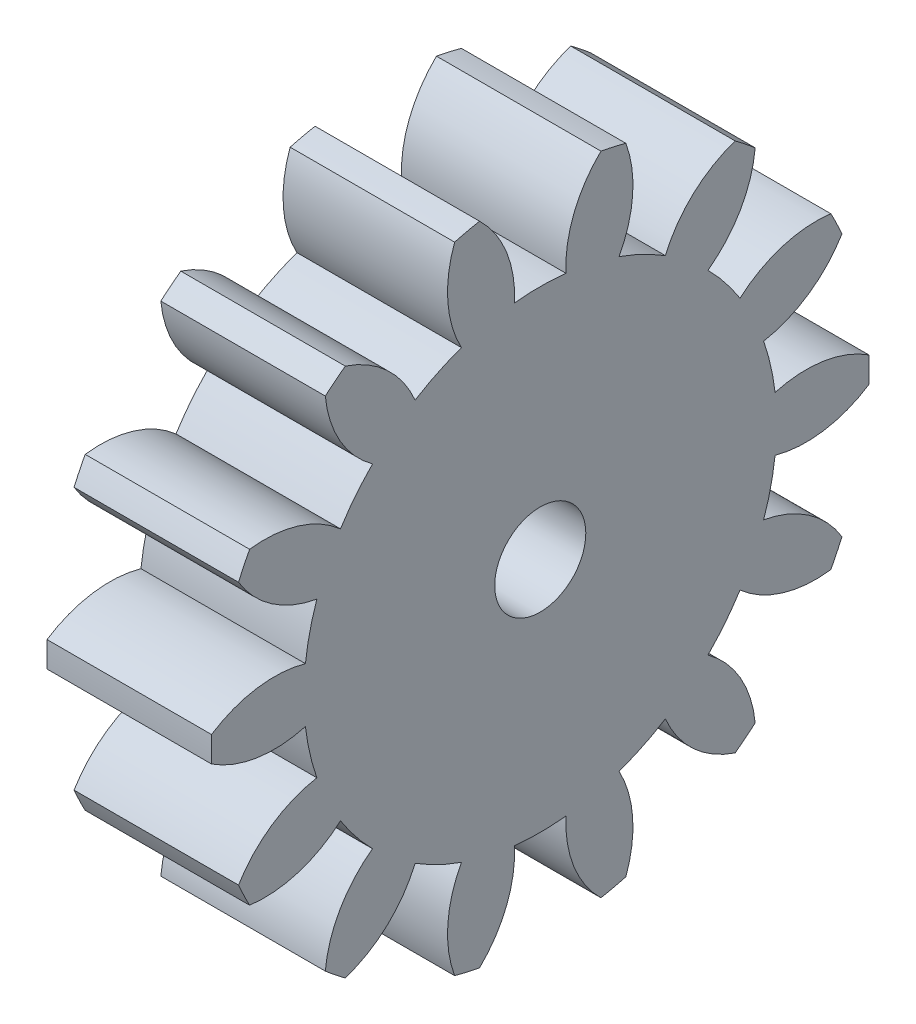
ISO-10303-21;
HEADER;
FILE_DESCRIPTION(('STEP AP214'),'2;1');
FILE_NAME('part.step','',(''),(''),'','','');
FILE_SCHEMA(('AUTOMOTIVE_DESIGN { 1 0 10303 214 1 1 1 1 }'));
ENDSEC;
DATA;
#1=APPLICATION_CONTEXT('core data for automotive mechanical design processes');
#2=APPLICATION_PROTOCOL_DEFINITION('international standard','automotive_design',2000,#1);
#3=PRODUCT_CONTEXT('',#1,'mechanical');
#4=PRODUCT('Part','Part','',(#3));
#5=PRODUCT_RELATED_PRODUCT_CATEGORY('part','',(#4));
#6=PRODUCT_DEFINITION_FORMATION('','',#4);
#7=PRODUCT_DEFINITION_CONTEXT('part definition',#1,'design');
#8=PRODUCT_DEFINITION('design','',#6,#7);
#9=PRODUCT_DEFINITION_SHAPE('','',#8);
#10=(LENGTH_UNIT() NAMED_UNIT(*) SI_UNIT(.MILLI.,.METRE.));
#11=(NAMED_UNIT(*) PLANE_ANGLE_UNIT() SI_UNIT($,.RADIAN.));
#12=(NAMED_UNIT(*) SI_UNIT($,.STERADIAN.) SOLID_ANGLE_UNIT());
#13=UNCERTAINTY_MEASURE_WITH_UNIT(LENGTH_MEASURE(1.E-05),#10,'distance_accuracy_value','');
#14=(GEOMETRIC_REPRESENTATION_CONTEXT(3) GLOBAL_UNCERTAINTY_ASSIGNED_CONTEXT((#13)) GLOBAL_UNIT_ASSIGNED_CONTEXT((#10,
#11,#12)) REPRESENTATION_CONTEXT('',''));
#15=CARTESIAN_POINT('',(0.,0.,0.));
#16=DIRECTION('',(0.,0.,1.));
#17=DIRECTION('',(1.,0.,0.));
#18=AXIS2_PLACEMENT_3D('',#15,#16,#17);
#19=CARTESIAN_POINT('',(4.7625,0.,0.));
#20=DIRECTION('',(-1.,0.,0.));
#21=DIRECTION('',(0.,0.,1.));
#22=AXIS2_PLACEMENT_3D('',#19,#20,#21);
#23=PLANE('',#22);
#24=CARTESIAN_POINT('',(4.7625,3.00480288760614,-4.46180556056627));
#25=DIRECTION('',(-1.,0.,0.));
#26=DIRECTION('',(0.,-0.433883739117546,-0.900968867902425));
#27=AXIS2_PLACEMENT_3D('',#24,#25,#26);
#28=CIRCLE('',#27,2.2225);
#29=CARTESIAN_POINT('',(4.7625,3.87179316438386,-2.41538573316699));
#30=VERTEX_POINT('',#29);
#31=CARTESIAN_POINT('',(4.7625,5.11468610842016,-3.76330785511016));
#32=VERTEX_POINT('',#31);
#33=EDGE_CURVE('E399',#30,#32,#28,.T.);
#34=ORIENTED_EDGE('',*,*,#33,.F.);
#35=CARTESIAN_POINT('',(4.7625,0.,0.));
#36=DIRECTION('',(-1.,0.,0.));
#37=DIRECTION('',(0.,-0.433883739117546,-0.900968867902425));
#38=AXIS2_PLACEMENT_3D('',#35,#36,#37);
#39=CIRCLE('',#38,4.5634275);
#40=CARTESIAN_POINT('',(4.7625,4.30244816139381,-1.521121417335));
#41=VERTEX_POINT('',#40);
#42=EDGE_CURVE('E398',#41,#30,#39,.T.);
#43=ORIENTED_EDGE('',*,*,#42,.F.);
#44=CARTESIAN_POINT('',(4.7625,5.36184401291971,0.432640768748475));
#45=DIRECTION('',(-1.,0.,0.));
#46=DIRECTION('',(0.,-0.433883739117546,-0.900968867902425));
#47=AXIS2_PLACEMENT_3D('',#44,#45,#46);
#48=CIRCLE('',#47,2.2225);
#49=CARTESIAN_POINT('',(4.7625,6.1312271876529,-1.65243855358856));
#50=VERTEX_POINT('',#49);
#51=EDGE_CURVE('E387',#50,#41,#48,.T.);
#52=ORIENTED_EDGE('',*,*,#51,.F.);
#53=CARTESIAN_POINT('',(4.7625,0.,0.));
#54=DIRECTION('',(-1.,0.,0.));
#55=DIRECTION('',(0.,0.,1.));
#56=AXIS2_PLACEMENT_3D('',#53,#54,#55);
#57=CIRCLE('',#56,6.35);
#58=CARTESIAN_POINT('',(4.7625,6.24101103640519,-1.17144408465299));
#59=VERTEX_POINT('',#58);
#60=EDGE_CURVE('E710',#59,#50,#57,.T.);
#61=ORIENTED_EDGE('',*,*,#60,.F.);
#62=CARTESIAN_POINT('',(4.7625,4.64313873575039,-2.71621279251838));
#63=DIRECTION('',(-1.,0.,0.));
#64=DIRECTION('',(0.,0.,-1.));
#65=AXIS2_PLACEMENT_3D('',#62,#63,#64);
#66=CIRCLE('',#65,2.2225);
#67=CARTESIAN_POINT('',(4.7625,4.53636169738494,-0.496279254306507));
#68=VERTEX_POINT('',#67);
#69=EDGE_CURVE('E683',#68,#59,#66,.T.);
#70=ORIENTED_EDGE('',*,*,#69,.F.);
#71=CARTESIAN_POINT('',(4.7625,0.,0.));
#72=DIRECTION('',(-1.,0.,0.));
#73=DIRECTION('',(0.,0.,-1.));
#74=AXIS2_PLACEMENT_3D('',#71,#72,#73);
#75=CIRCLE('',#74,4.5634275);
#76=CARTESIAN_POINT('',(4.7625,4.53636169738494,0.496279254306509));
#77=VERTEX_POINT('',#76);
#78=EDGE_CURVE('E688',#77,#68,#75,.T.);
#79=ORIENTED_EDGE('',*,*,#78,.F.);
#80=CARTESIAN_POINT('',(4.7625,4.64313873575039,2.71621279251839));
#81=DIRECTION('',(-1.,0.,0.));
#82=DIRECTION('',(0.,0.,-1.));
#83=AXIS2_PLACEMENT_3D('',#80,#81,#82);
#84=CIRCLE('',#83,2.2225);
#85=CARTESIAN_POINT('',(4.7625,6.24101103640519,1.17144408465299));
#86=VERTEX_POINT('',#85);
#87=EDGE_CURVE('E685',#86,#77,#84,.T.);
#88=ORIENTED_EDGE('',*,*,#87,.F.);
#89=CARTESIAN_POINT('',(4.7625,6.13122718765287,1.65243855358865));
#90=VERTEX_POINT('',#89);
#91=EDGE_CURVE('E708',#90,#86,#57,.T.);
#92=ORIENTED_EDGE('',*,*,#91,.F.);
#93=CARTESIAN_POINT('',(4.7625,5.36184401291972,-0.432640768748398));
#94=DIRECTION('',(-1.,0.,0.));
#95=DIRECTION('',(0.,0.433883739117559,-0.900968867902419));
#96=AXIS2_PLACEMENT_3D('',#93,#94,#95);
#97=CIRCLE('',#96,2.2225);
#98=CARTESIAN_POINT('',(4.7625,4.30244816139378,1.52112141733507));
#99=VERTEX_POINT('',#98);
#100=EDGE_CURVE('E661',#99,#90,#97,.T.);
#101=ORIENTED_EDGE('',*,*,#100,.F.);
#102=CARTESIAN_POINT('',(4.7625,0.,0.));
#103=DIRECTION('',(-1.,0.,0.));
#104=DIRECTION('',(0.,0.433883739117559,-0.900968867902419));
#105=AXIS2_PLACEMENT_3D('',#102,#103,#104);
#106=CIRCLE('',#105,4.5634275);
#107=CARTESIAN_POINT('',(4.7625,3.87179316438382,2.41538573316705));
#108=VERTEX_POINT('',#107);
#109=EDGE_CURVE('E666',#108,#99,#106,.T.);
#110=ORIENTED_EDGE('',*,*,#109,.F.);
#111=CARTESIAN_POINT('',(4.7625,3.00480288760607,4.46180556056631));
#112=DIRECTION('',(-1.,0.,0.));
#113=DIRECTION('',(0.,0.433883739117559,-0.900968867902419));
#114=AXIS2_PLACEMENT_3D('',#111,#112,#113);
#115=CIRCLE('',#114,2.2225);
#116=CARTESIAN_POINT('',(4.7625,5.1146861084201,3.76330785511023));
#117=VERTEX_POINT('',#116);
#118=EDGE_CURVE('E663',#117,#108,#115,.T.);
#119=ORIENTED_EDGE('',*,*,#118,.F.);
#120=CARTESIAN_POINT('',(4.7625,4.80707859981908,4.14903547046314));
#121=VERTEX_POINT('',#120);
#122=EDGE_CURVE('E807',#121,#117,#57,.T.);
#123=ORIENTED_EDGE('',*,*,#122,.F.);
#124=CARTESIAN_POINT('',(4.7625,5.01857032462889,1.93662106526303));
#125=DIRECTION('',(-1.,0.,0.));
#126=DIRECTION('',(0.,0.781831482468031,-0.623489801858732));
#127=AXIS2_PLACEMENT_3D('',#124,#125,#126);
#128=CIRCLE('',#127,2.2225);
#129=CARTESIAN_POINT('',(4.7625,3.21638200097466,3.2372453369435));
#130=VERTEX_POINT('',#129);
#131=EDGE_CURVE('E639',#130,#121,#128,.T.);
#132=ORIENTED_EDGE('',*,*,#131,.F.);
#133=CARTESIAN_POINT('',(4.7625,0.,0.));
#134=DIRECTION('',(-1.,0.,0.));
#135=DIRECTION('',(0.,0.781831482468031,-0.623489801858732));
#136=AXIS2_PLACEMENT_3D('',#133,#134,#135);
#137=CIRCLE('',#136,4.5634275);
#138=CARTESIAN_POINT('',(4.7625,2.44036851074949,3.85609544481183));
#139=VERTEX_POINT('',#138);
#140=EDGE_CURVE('E644',#139,#130,#137,.T.);
#141=ORIENTED_EDGE('',*,*,#140,.F.);
#142=CARTESIAN_POINT('',(4.7625,0.771328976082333,5.32368301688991));
#143=DIRECTION('',(-1.,0.,0.));
#144=DIRECTION('',(0.,0.781831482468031,-0.623489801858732));
#145=AXIS2_PLACEMENT_3D('',#142,#143,#144);
#146=CIRCLE('',#145,2.2225);
#147=CARTESIAN_POINT('',(4.7625,2.97533486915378,5.6098023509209));
#148=VERTEX_POINT('',#147);
#149=EDGE_CURVE('E641',#148,#139,#146,.T.);
#150=ORIENTED_EDGE('',*,*,#149,.F.);
#151=CARTESIAN_POINT('',(4.7625,2.53082914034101,5.82386502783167));
#152=VERTEX_POINT('',#151);
#153=EDGE_CURVE('E802',#152,#148,#57,.T.);
#154=ORIENTED_EDGE('',*,*,#153,.F.);
#155=CARTESIAN_POINT('',(4.7625,3.68130723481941,3.92231134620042));
#156=DIRECTION('',(-1.,0.,0.));
#157=DIRECTION('',(0.,0.974927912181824,-0.222520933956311));
#158=AXIS2_PLACEMENT_3D('',#155,#156,#157);
#159=CIRCLE('',#158,2.2225);
#160=CARTESIAN_POINT('',(4.7625,1.49327193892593,4.31219311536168));
#161=VERTEX_POINT('',#160);
#162=EDGE_CURVE('E617',#161,#152,#159,.T.);
#163=ORIENTED_EDGE('',*,*,#162,.F.);
#164=CARTESIAN_POINT('',(4.7625,0.,0.));
#165=DIRECTION('',(-1.,0.,0.));
#166=DIRECTION('',(0.,0.974927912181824,-0.222520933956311));
#167=AXIS2_PLACEMENT_3D('',#164,#165,#166);
#168=CIRCLE('',#167,4.5634275);
#169=CARTESIAN_POINT('',(4.7625,0.525598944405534,4.53305816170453));
#170=VERTEX_POINT('',#169);
#171=EDGE_CURVE('E622',#170,#161,#168,.T.);
#172=ORIENTED_EDGE('',*,*,#171,.F.);
#173=CARTESIAN_POINT('',(4.7625,-1.61491609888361,5.13113976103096));
#174=DIRECTION('',(-1.,0.,0.));
#175=DIRECTION('',(0.,0.974927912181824,-0.222520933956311));
#176=AXIS2_PLACEMENT_3D('',#173,#174,#175);
#177=CIRCLE('',#176,2.2225);
#178=CARTESIAN_POINT('',(4.7625,0.246682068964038,6.34520669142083));
#179=VERTEX_POINT('',#178);
#180=EDGE_CURVE('E619',#179,#170,#177,.T.);
#181=ORIENTED_EDGE('',*,*,#180,.F.);
#182=CARTESIAN_POINT('',(4.7625,-0.246682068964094,6.34520669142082));
#183=VERTEX_POINT('',#182);
#184=EDGE_CURVE('E797',#183,#179,#57,.T.);
#185=ORIENTED_EDGE('',*,*,#184,.F.);
#186=CARTESIAN_POINT('',(4.7625,1.61491609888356,5.13113976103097));
#187=DIRECTION('',(-1.,0.,0.));
#188=DIRECTION('',(0.,0.974927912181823,0.222520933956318));
#189=AXIS2_PLACEMENT_3D('',#186,#187,#188);
#190=CIRCLE('',#189,2.2225);
#191=CARTESIAN_POINT('',(4.7625,-0.525598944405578,4.53305816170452));
#192=VERTEX_POINT('',#191);
#193=EDGE_CURVE('E595',#192,#183,#190,.T.);
#194=ORIENTED_EDGE('',*,*,#193,.F.);
#195=CARTESIAN_POINT('',(4.7625,0.,0.));
#196=DIRECTION('',(-1.,0.,0.));
#197=DIRECTION('',(0.,0.974927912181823,0.222520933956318));
#198=AXIS2_PLACEMENT_3D('',#195,#196,#197);
#199=CIRCLE('',#198,4.5634275);
#200=CARTESIAN_POINT('',(4.7625,-1.49327193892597,4.31219311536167));
#201=VERTEX_POINT('',#200);
#202=EDGE_CURVE('E600',#201,#192,#199,.T.);
#203=ORIENTED_EDGE('',*,*,#202,.F.);
#204=CARTESIAN_POINT('',(4.7625,-3.68130723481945,3.92231134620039));
#205=DIRECTION('',(-1.,0.,0.));
#206=DIRECTION('',(0.,0.974927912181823,0.222520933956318));
#207=AXIS2_PLACEMENT_3D('',#204,#205,#206);
#208=CIRCLE('',#207,2.2225);
#209=CARTESIAN_POINT('',(4.7625,-2.53082914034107,5.82386502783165));
#210=VERTEX_POINT('',#209);
#211=EDGE_CURVE('E597',#210,#201,#208,.T.);
#212=ORIENTED_EDGE('',*,*,#211,.F.);
#213=CARTESIAN_POINT('',(4.7625,-2.97533486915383,5.60980235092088));
#214=VERTEX_POINT('',#213);
#215=EDGE_CURVE('E792',#214,#210,#57,.T.);
#216=ORIENTED_EDGE('',*,*,#215,.F.);
#217=CARTESIAN_POINT('',(4.7625,-0.77132897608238,5.32368301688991));
#218=DIRECTION('',(-1.,0.,0.));
#219=DIRECTION('',(0.,0.781831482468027,0.623489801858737));
#220=AXIS2_PLACEMENT_3D('',#217,#218,#219);
#221=CIRCLE('',#220,2.2225);
#222=CARTESIAN_POINT('',(4.7625,-2.44036851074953,3.85609544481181));
#223=VERTEX_POINT('',#222);
#224=EDGE_CURVE('E573',#223,#214,#221,.T.);
#225=ORIENTED_EDGE('',*,*,#224,.F.);
#226=CARTESIAN_POINT('',(4.7625,0.,0.));
#227=DIRECTION('',(-1.,0.,0.));
#228=DIRECTION('',(0.,0.781831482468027,0.623489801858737));
#229=AXIS2_PLACEMENT_3D('',#226,#227,#228);
#230=CIRCLE('',#229,4.5634275);
#231=CARTESIAN_POINT('',(4.7625,-3.2163820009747,3.23724533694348));
#232=VERTEX_POINT('',#231);
#233=EDGE_CURVE('E578',#232,#223,#230,.T.);
#234=ORIENTED_EDGE('',*,*,#233,.F.);
#235=CARTESIAN_POINT('',(4.7625,-5.01857032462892,1.936621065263));
#236=DIRECTION('',(-1.,0.,0.));
#237=DIRECTION('',(0.,0.781831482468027,0.623489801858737));
#238=AXIS2_PLACEMENT_3D('',#235,#236,#237);
#239=CIRCLE('',#238,2.2225);
#240=CARTESIAN_POINT('',(4.7625,-4.80707859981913,4.14903547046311));
#241=VERTEX_POINT('',#240);
#242=EDGE_CURVE('E575',#241,#232,#239,.T.);
#243=ORIENTED_EDGE('',*,*,#242,.F.);
#244=CARTESIAN_POINT('',(4.7625,-5.11468610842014,3.76330785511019));
#245=VERTEX_POINT('',#244);
#246=EDGE_CURVE('E787',#245,#241,#57,.T.);
#247=ORIENTED_EDGE('',*,*,#246,.F.);
#248=CARTESIAN_POINT('',(4.7625,-3.00480288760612,4.46180556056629));
#249=DIRECTION('',(-1.,0.,0.));
#250=DIRECTION('',(0.,0.433883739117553,0.900968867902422));
#251=AXIS2_PLACEMENT_3D('',#248,#249,#250);
#252=CIRCLE('',#251,2.2225);
#253=CARTESIAN_POINT('',(4.7625,-3.87179316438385,2.41538573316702));
#254=VERTEX_POINT('',#253);
#255=EDGE_CURVE('E551',#254,#245,#252,.T.);
#256=ORIENTED_EDGE('',*,*,#255,.F.);
#257=CARTESIAN_POINT('',(4.7625,0.,0.));
#258=DIRECTION('',(-1.,0.,0.));
#259=DIRECTION('',(0.,0.433883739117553,0.900968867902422));
#260=AXIS2_PLACEMENT_3D('',#257,#258,#259);
#261=CIRCLE('',#260,4.5634275);
#262=CARTESIAN_POINT('',(4.7625,-4.30244816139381,1.52112141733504));
#263=VERTEX_POINT('',#262);
#264=EDGE_CURVE('E556',#263,#254,#261,.T.);
#265=ORIENTED_EDGE('',*,*,#264,.F.);
#266=CARTESIAN_POINT('',(4.7625,-5.36184401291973,-0.432640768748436));
#267=DIRECTION('',(-1.,0.,0.));
#268=DIRECTION('',(0.,0.433883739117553,0.900968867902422));
#269=AXIS2_PLACEMENT_3D('',#266,#267,#268);
#270=CIRCLE('',#269,2.2225);
#271=CARTESIAN_POINT('',(4.7625,-6.1312271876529,1.65243855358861));
#272=VERTEX_POINT('',#271);
#273=EDGE_CURVE('E553',#272,#263,#270,.T.);
#274=ORIENTED_EDGE('',*,*,#273,.F.);
#275=CARTESIAN_POINT('',(4.7625,-6.24101103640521,1.17144408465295));
#276=VERTEX_POINT('',#275);
#277=EDGE_CURVE('E782',#276,#272,#57,.T.);
#278=ORIENTED_EDGE('',*,*,#277,.F.);
#279=CARTESIAN_POINT('',(4.7625,-4.64313873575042,2.71621279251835));
#280=DIRECTION('',(-1.,0.,0.));
#281=DIRECTION('',(0.,0.,1.));
#282=AXIS2_PLACEMENT_3D('',#279,#280,#281);
#283=CIRCLE('',#282,2.2225);
#284=CARTESIAN_POINT('',(4.7625,-4.53636169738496,0.496279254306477));
#285=VERTEX_POINT('',#284);
#286=EDGE_CURVE('E529',#285,#276,#283,.T.);
#287=ORIENTED_EDGE('',*,*,#286,.F.);
#288=CARTESIAN_POINT('',(4.7625,0.,0.));
#289=DIRECTION('',(-1.,0.,0.));
#290=DIRECTION('',(0.,0.,1.));
#291=AXIS2_PLACEMENT_3D('',#288,#289,#290);
#292=CIRCLE('',#291,4.5634275);
#293=CARTESIAN_POINT('',(4.7625,-4.53636169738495,-0.496279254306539));
#294=VERTEX_POINT('',#293);
#295=EDGE_CURVE('E534',#294,#285,#292,.T.);
#296=ORIENTED_EDGE('',*,*,#295,.F.);
#297=CARTESIAN_POINT('',(4.7625,-4.64313873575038,-2.71621279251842));
#298=DIRECTION('',(-1.,0.,0.));
#299=DIRECTION('',(0.,0.,1.));
#300=AXIS2_PLACEMENT_3D('',#297,#298,#299);
#301=CIRCLE('',#300,2.2225);
#302=CARTESIAN_POINT('',(4.7625,-6.2410110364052,-1.17144408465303));
#303=VERTEX_POINT('',#302);
#304=EDGE_CURVE('E531',#303,#294,#301,.T.);
#305=ORIENTED_EDGE('',*,*,#304,.F.);
#306=CARTESIAN_POINT('',(4.7625,-6.13122718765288,-1.65243855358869));
#307=VERTEX_POINT('',#306);
#308=EDGE_CURVE('E777',#307,#303,#57,.T.);
#309=ORIENTED_EDGE('',*,*,#308,.F.);
#310=CARTESIAN_POINT('',(4.7625,-5.36184401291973,0.432640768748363));
#311=DIRECTION('',(-1.,0.,0.));
#312=DIRECTION('',(0.,-0.433883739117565,0.900968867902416));
#313=AXIS2_PLACEMENT_3D('',#310,#311,#312);
#314=CIRCLE('',#313,2.2225);
#315=CARTESIAN_POINT('',(4.7625,-4.30244816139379,-1.52112141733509));
#316=VERTEX_POINT('',#315);
#317=EDGE_CURVE('E507',#316,#307,#314,.T.);
#318=ORIENTED_EDGE('',*,*,#317,.F.);
#319=CARTESIAN_POINT('',(4.7625,0.,0.));
#320=DIRECTION('',(-1.,0.,0.));
#321=DIRECTION('',(0.,-0.433883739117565,0.900968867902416));
#322=AXIS2_PLACEMENT_3D('',#319,#320,#321);
#323=CIRCLE('',#322,4.5634275);
#324=CARTESIAN_POINT('',(4.7625,-3.87179316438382,-2.41538573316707));
#325=VERTEX_POINT('',#324);
#326=EDGE_CURVE('E512',#325,#316,#323,.T.);
#327=ORIENTED_EDGE('',*,*,#326,.F.);
#328=CARTESIAN_POINT('',(4.7625,-3.00480288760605,-4.46180556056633));
#329=DIRECTION('',(-1.,0.,0.));
#330=DIRECTION('',(0.,-0.433883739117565,0.900968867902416));
#331=AXIS2_PLACEMENT_3D('',#328,#329,#330);
#332=CIRCLE('',#331,2.2225);
#333=CARTESIAN_POINT('',(4.7625,-5.11468610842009,-3.76330785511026));
#334=VERTEX_POINT('',#333);
#335=EDGE_CURVE('E509',#334,#325,#332,.T.);
#336=ORIENTED_EDGE('',*,*,#335,.F.);
#337=CARTESIAN_POINT('',(4.7625,-4.80707859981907,-4.14903547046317));
#338=VERTEX_POINT('',#337);
#339=EDGE_CURVE('E772',#338,#334,#57,.T.);
#340=ORIENTED_EDGE('',*,*,#339,.F.);
#341=CARTESIAN_POINT('',(4.7625,-5.01857032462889,-1.93662106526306));
#342=DIRECTION('',(-1.,0.,0.));
#343=DIRECTION('',(0.,-0.781831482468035,0.623489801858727));
#344=AXIS2_PLACEMENT_3D('',#341,#342,#343);
#345=CIRCLE('',#344,2.2225);
#346=CARTESIAN_POINT('',(4.7625,-3.21638200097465,-3.23724533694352));
#347=VERTEX_POINT('',#346);
#348=EDGE_CURVE('E485',#347,#338,#345,.T.);
#349=ORIENTED_EDGE('',*,*,#348,.F.);
#350=CARTESIAN_POINT('',(4.7625,0.,0.));
#351=DIRECTION('',(-1.,0.,0.));
#352=DIRECTION('',(0.,-0.781831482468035,0.623489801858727));
#353=AXIS2_PLACEMENT_3D('',#350,#351,#352);
#354=CIRCLE('',#353,4.5634275);
#355=CARTESIAN_POINT('',(4.7625,-2.44036851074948,-3.85609544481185));
#356=VERTEX_POINT('',#355);
#357=EDGE_CURVE('E490',#356,#347,#354,.T.);
#358=ORIENTED_EDGE('',*,*,#357,.F.);
#359=CARTESIAN_POINT('',(4.7625,-0.771328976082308,-5.32368301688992));
#360=DIRECTION('',(-1.,0.,0.));
#361=DIRECTION('',(0.,-0.781831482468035,0.623489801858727));
#362=AXIS2_PLACEMENT_3D('',#359,#360,#361);
#363=CIRCLE('',#362,2.2225);
#364=CARTESIAN_POINT('',(4.7625,-2.97533486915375,-5.60980235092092));
#365=VERTEX_POINT('',#364);
#366=EDGE_CURVE('E487',#365,#356,#363,.T.);
#367=ORIENTED_EDGE('',*,*,#366,.F.);
#368=CARTESIAN_POINT('',(4.7625,-2.53082914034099,-5.82386502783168));
#369=VERTEX_POINT('',#368);
#370=EDGE_CURVE('E767',#369,#365,#57,.T.);
#371=ORIENTED_EDGE('',*,*,#370,.F.);
#372=CARTESIAN_POINT('',(4.7625,-3.6813072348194,-3.92231134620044));
#373=DIRECTION('',(-1.,0.,0.));
#374=DIRECTION('',(0.,-0.974927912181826,0.222520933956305));
#375=AXIS2_PLACEMENT_3D('',#372,#373,#374);
#376=CIRCLE('',#375,2.2225);
#377=CARTESIAN_POINT('',(4.7625,-1.49327193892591,-4.31219311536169));
#378=VERTEX_POINT('',#377);
#379=EDGE_CURVE('E463',#378,#369,#376,.T.);
#380=ORIENTED_EDGE('',*,*,#379,.F.);
#381=CARTESIAN_POINT('',(4.7625,0.,0.));
#382=DIRECTION('',(-1.,0.,0.));
#383=DIRECTION('',(0.,-0.974927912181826,0.222520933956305));
#384=AXIS2_PLACEMENT_3D('',#381,#382,#383);
#385=CIRCLE('',#384,4.5634275);
#386=CARTESIAN_POINT('',(4.7625,-0.525598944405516,-4.53305816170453));
#387=VERTEX_POINT('',#386);
#388=EDGE_CURVE('E468',#387,#378,#385,.T.);
#389=ORIENTED_EDGE('',*,*,#388,.F.);
#390=CARTESIAN_POINT('',(4.7625,1.61491609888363,-5.13113976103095));
#391=DIRECTION('',(-1.,0.,0.));
#392=DIRECTION('',(0.,-0.974927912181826,0.222520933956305));
#393=AXIS2_PLACEMENT_3D('',#390,#391,#392);
#394=CIRCLE('',#393,2.2225);
#395=CARTESIAN_POINT('',(4.7625,-0.246682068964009,-6.34520669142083));
#396=VERTEX_POINT('',#395);
#397=EDGE_CURVE('E465',#396,#387,#394,.T.);
#398=ORIENTED_EDGE('',*,*,#397,.F.);
#399=CARTESIAN_POINT('',(4.7625,0.246682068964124,-6.34520669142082));
#400=VERTEX_POINT('',#399);
#401=EDGE_CURVE('E762',#400,#396,#57,.T.);
#402=ORIENTED_EDGE('',*,*,#401,.F.);
#403=CARTESIAN_POINT('',(4.7625,-1.61491609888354,-5.13113976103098));
#404=DIRECTION('',(-1.,0.,0.));
#405=DIRECTION('',(0.,-0.974927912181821,-0.222520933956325));
#406=AXIS2_PLACEMENT_3D('',#403,#404,#405);
#407=CIRCLE('',#406,2.2225);
#408=CARTESIAN_POINT('',(4.7625,0.525598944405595,-4.53305816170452));
#409=VERTEX_POINT('',#408);
#410=EDGE_CURVE('E441',#409,#400,#407,.T.);
#411=ORIENTED_EDGE('',*,*,#410,.F.);
#412=CARTESIAN_POINT('',(4.7625,0.,0.));
#413=DIRECTION('',(-1.,0.,0.));
#414=DIRECTION('',(0.,-0.974927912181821,-0.222520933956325));
#415=AXIS2_PLACEMENT_3D('',#412,#413,#414);
#416=CIRCLE('',#415,4.5634275);
#417=CARTESIAN_POINT('',(4.7625,1.49327193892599,-4.31219311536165));
#418=VERTEX_POINT('',#417);
#419=EDGE_CURVE('E446',#418,#409,#416,.T.);
#420=ORIENTED_EDGE('',*,*,#419,.F.);
#421=CARTESIAN_POINT('',(4.7625,3.68130723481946,-3.92231134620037));
#422=DIRECTION('',(-1.,0.,0.));
#423=DIRECTION('',(0.,-0.974927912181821,-0.222520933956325));
#424=AXIS2_PLACEMENT_3D('',#421,#422,#423);
#425=CIRCLE('',#424,2.2225);
#426=CARTESIAN_POINT('',(4.7625,2.53082914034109,-5.82386502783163));
#427=VERTEX_POINT('',#426);
#428=EDGE_CURVE('E443',#427,#418,#425,.T.);
#429=ORIENTED_EDGE('',*,*,#428,.F.);
#430=CARTESIAN_POINT('',(4.7625,2.97533486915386,-5.60980235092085));
#431=VERTEX_POINT('',#430);
#432=EDGE_CURVE('E761',#431,#427,#57,.T.);
#433=ORIENTED_EDGE('',*,*,#432,.F.);
#434=CARTESIAN_POINT('',(4.7625,0.771328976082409,-5.3236830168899));
#435=DIRECTION('',(-1.,0.,0.));
#436=DIRECTION('',(0.,-0.781831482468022,-0.623489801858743));
#437=AXIS2_PLACEMENT_3D('',#434,#435,#436);
#438=CIRCLE('',#437,2.2225);
#439=CARTESIAN_POINT('',(4.7625,2.44036851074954,-3.85609544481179));
#440=VERTEX_POINT('',#439);
#441=EDGE_CURVE('E421',#440,#431,#438,.T.);
#442=ORIENTED_EDGE('',*,*,#441,.F.);
#443=CARTESIAN_POINT('',(4.7625,0.,0.));
#444=DIRECTION('',(-1.,0.,0.));
#445=DIRECTION('',(0.,-0.781831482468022,-0.623489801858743));
#446=AXIS2_PLACEMENT_3D('',#443,#444,#445);
#447=CIRCLE('',#446,4.5634275);
#448=CARTESIAN_POINT('',(4.7625,3.21638200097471,-3.23724533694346));
#449=VERTEX_POINT('',#448);
#450=EDGE_CURVE('E426',#449,#440,#447,.T.);
#451=ORIENTED_EDGE('',*,*,#450,.F.);
#452=CARTESIAN_POINT('',(4.7625,5.01857032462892,-1.93662106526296));
#453=DIRECTION('',(-1.,0.,0.));
#454=DIRECTION('',(0.,-0.781831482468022,-0.623489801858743));
#455=AXIS2_PLACEMENT_3D('',#452,#453,#454);
#456=CIRCLE('',#455,2.2225);
#457=CARTESIAN_POINT('',(4.7625,4.80707859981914,-4.14903547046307));
#458=VERTEX_POINT('',#457);
#459=EDGE_CURVE('E423',#458,#449,#456,.T.);
#460=ORIENTED_EDGE('',*,*,#459,.F.);
#461=EDGE_CURVE('E713',#32,#458,#57,.T.);
#462=ORIENTED_EDGE('',*,*,#461,.F.);
#463=EDGE_LOOP('',(#34,#43,#52,#61,#70,#79,#88,#92,#101,#110,#119,#123,#132,#141,#150,#154,#163,
#172,#181,#185,#194,#203,#212,#216,#225,#234,#243,#247,#256,#265,#274,#278,#287,#296,#305,#309,
#318,#327,#336,#340,#349,#358,#367,#371,#380,#389,#398,#402,#411,#420,#429,#433,#442,#451,#460,#462));
#464=FACE_BOUND('',#463,.T.);
#465=CARTESIAN_POINT('',(4.7625,0.,0.));
#466=DIRECTION('',(1.,0.,0.));
#467=DIRECTION('',(0.,0.,-1.));
#468=AXIS2_PLACEMENT_3D('',#465,#466,#467);
#469=CIRCLE('',#468,0.879475);
#470=CARTESIAN_POINT('',(4.7625,0.,-0.879474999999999));
#471=VERTEX_POINT('',#470);
#472=EDGE_CURVE('E416',#471,#471,#469,.T.);
#473=ORIENTED_EDGE('',*,*,#472,.F.);
#474=EDGE_LOOP('',(#473));
#475=FACE_BOUND('',#474,.T.);
#476=ADVANCED_FACE('F35',(#464,#475),#23,.F.);
#477=CARTESIAN_POINT('',(1.5875,0.,0.));
#478=DIRECTION('',(1.,0.,0.));
#479=DIRECTION('',(0.,0.,-1.));
#480=AXIS2_PLACEMENT_3D('',#477,#478,#479);
#481=PLANE('',#480);
#482=CARTESIAN_POINT('',(1.5875,3.00480288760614,-4.46180556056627));
#483=DIRECTION('',(-1.,0.,0.));
#484=DIRECTION('',(0.,-0.433883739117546,-0.900968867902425));
#485=AXIS2_PLACEMENT_3D('',#482,#483,#484);
#486=CIRCLE('',#485,2.2225);
#487=CARTESIAN_POINT('',(1.5875,3.87179316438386,-2.41538573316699));
#488=VERTEX_POINT('',#487);
#489=CARTESIAN_POINT('',(1.5875,5.11468610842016,-3.76330785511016));
#490=VERTEX_POINT('',#489);
#491=EDGE_CURVE('E49',#488,#490,#486,.T.);
#492=ORIENTED_EDGE('',*,*,#491,.T.);
#493=CARTESIAN_POINT('',(1.5875,0.,0.));
#494=DIRECTION('',(-1.,0.,0.));
#495=DIRECTION('',(0.,0.,1.));
#496=AXIS2_PLACEMENT_3D('',#493,#494,#495);
#497=CIRCLE('',#496,6.35);
#498=CARTESIAN_POINT('',(1.5875,4.80707859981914,-4.14903547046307));
#499=VERTEX_POINT('',#498);
#500=EDGE_CURVE('E709',#490,#499,#497,.T.);
#501=ORIENTED_EDGE('',*,*,#500,.T.);
#502=CARTESIAN_POINT('',(1.5875,5.01857032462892,-1.93662106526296));
#503=DIRECTION('',(1.,0.,0.));
#504=DIRECTION('',(0.,0.,-1.));
#505=AXIS2_PLACEMENT_3D('',#502,#503,#504);
#506=CIRCLE('',#505,2.2225);
#507=CARTESIAN_POINT('',(1.5875,3.21638200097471,-3.23724533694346));
#508=VERTEX_POINT('',#507);
#509=EDGE_CURVE('E42',#508,#499,#506,.T.);
#510=ORIENTED_EDGE('',*,*,#509,.F.);
#511=CARTESIAN_POINT('',(1.5875,0.,0.));
#512=DIRECTION('',(-1.,0.,0.));
#513=DIRECTION('',(0.,-0.781831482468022,-0.623489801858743));
#514=AXIS2_PLACEMENT_3D('',#511,#512,#513);
#515=CIRCLE('',#514,4.5634275);
#516=CARTESIAN_POINT('',(1.5875,2.44036851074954,-3.85609544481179));
#517=VERTEX_POINT('',#516);
#518=EDGE_CURVE('E424',#508,#517,#515,.T.);
#519=ORIENTED_EDGE('',*,*,#518,.T.);
#520=CARTESIAN_POINT('',(1.5875,0.771328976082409,-5.3236830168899));
#521=DIRECTION('',(-1.,0.,0.));
#522=DIRECTION('',(0.,-0.781831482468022,-0.623489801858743));
#523=AXIS2_PLACEMENT_3D('',#520,#521,#522);
#524=CIRCLE('',#523,2.2225);
#525=CARTESIAN_POINT('',(1.5875,2.97533486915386,-5.60980235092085));
#526=VERTEX_POINT('',#525);
#527=EDGE_CURVE('E57',#517,#526,#524,.T.);
#528=ORIENTED_EDGE('',*,*,#527,.T.);
#529=CARTESIAN_POINT('',(1.5875,2.53082914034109,-5.82386502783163));
#530=VERTEX_POINT('',#529);
#531=EDGE_CURVE('E1024',#526,#530,#497,.T.);
#532=ORIENTED_EDGE('',*,*,#531,.T.);
#533=CARTESIAN_POINT('',(1.5875,3.68130723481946,-3.92231134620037));
#534=DIRECTION('',(1.,0.,0.));
#535=DIRECTION('',(0.,0.,-1.));
#536=AXIS2_PLACEMENT_3D('',#533,#534,#535);
#537=CIRCLE('',#536,2.2225);
#538=CARTESIAN_POINT('',(1.5875,1.49327193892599,-4.31219311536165));
#539=VERTEX_POINT('',#538);
#540=EDGE_CURVE('E746',#539,#530,#537,.T.);
#541=ORIENTED_EDGE('',*,*,#540,.F.);
#542=CARTESIAN_POINT('',(1.5875,0.,0.));
#543=DIRECTION('',(-1.,0.,0.));
#544=DIRECTION('',(0.,-0.974927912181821,-0.222520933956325));
#545=AXIS2_PLACEMENT_3D('',#542,#543,#544);
#546=CIRCLE('',#545,4.5634275);
#547=CARTESIAN_POINT('',(1.5875,0.525598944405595,-4.53305816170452));
#548=VERTEX_POINT('',#547);
#549=EDGE_CURVE('E444',#539,#548,#546,.T.);
#550=ORIENTED_EDGE('',*,*,#549,.T.);
#551=CARTESIAN_POINT('',(1.5875,-1.61491609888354,-5.13113976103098));
#552=DIRECTION('',(-1.,0.,0.));
#553=DIRECTION('',(0.,-0.974927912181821,-0.222520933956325));
#554=AXIS2_PLACEMENT_3D('',#551,#552,#553);
#555=CIRCLE('',#554,2.2225);
#556=CARTESIAN_POINT('',(1.5875,0.246682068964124,-6.34520669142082));
#557=VERTEX_POINT('',#556);
#558=EDGE_CURVE('E440',#548,#557,#555,.T.);
#559=ORIENTED_EDGE('',*,*,#558,.T.);
#560=CARTESIAN_POINT('',(1.5875,-0.246682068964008,-6.34520669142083));
#561=VERTEX_POINT('',#560);
#562=EDGE_CURVE('E1025',#557,#561,#497,.T.);
#563=ORIENTED_EDGE('',*,*,#562,.T.);
#564=CARTESIAN_POINT('',(1.5875,1.61491609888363,-5.13113976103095));
#565=DIRECTION('',(1.,0.,0.));
#566=DIRECTION('',(0.,0.,-1.));
#567=AXIS2_PLACEMENT_3D('',#564,#565,#566);
#568=CIRCLE('',#567,2.2225);
#569=CARTESIAN_POINT('',(1.5875,-0.525598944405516,-4.53305816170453));
#570=VERTEX_POINT('',#569);
#571=EDGE_CURVE('E743',#570,#561,#568,.T.);
#572=ORIENTED_EDGE('',*,*,#571,.F.);
#573=CARTESIAN_POINT('',(1.5875,0.,0.));
#574=DIRECTION('',(-1.,0.,0.));
#575=DIRECTION('',(0.,-0.974927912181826,0.222520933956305));
#576=AXIS2_PLACEMENT_3D('',#573,#574,#575);
#577=CIRCLE('',#576,4.5634275);
#578=CARTESIAN_POINT('',(1.5875,-1.49327193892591,-4.31219311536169));
#579=VERTEX_POINT('',#578);
#580=EDGE_CURVE('E466',#570,#579,#577,.T.);
#581=ORIENTED_EDGE('',*,*,#580,.T.);
#582=CARTESIAN_POINT('',(1.5875,-3.6813072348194,-3.92231134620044));
#583=DIRECTION('',(-1.,0.,0.));
#584=DIRECTION('',(0.,-0.974927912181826,0.222520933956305));
#585=AXIS2_PLACEMENT_3D('',#582,#583,#584);
#586=CIRCLE('',#585,2.2225);
#587=CARTESIAN_POINT('',(1.5875,-2.53082914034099,-5.82386502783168));
#588=VERTEX_POINT('',#587);
#589=EDGE_CURVE('E462',#579,#588,#586,.T.);
#590=ORIENTED_EDGE('',*,*,#589,.T.);
#591=CARTESIAN_POINT('',(1.5875,-2.97533486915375,-5.60980235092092));
#592=VERTEX_POINT('',#591);
#593=EDGE_CURVE('E1028',#588,#592,#497,.T.);
#594=ORIENTED_EDGE('',*,*,#593,.T.);
#595=CARTESIAN_POINT('',(1.5875,-0.771328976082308,-5.32368301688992));
#596=DIRECTION('',(1.,0.,0.));
#597=DIRECTION('',(0.,0.,-1.));
#598=AXIS2_PLACEMENT_3D('',#595,#596,#597);
#599=CIRCLE('',#598,2.2225);
#600=CARTESIAN_POINT('',(1.5875,-2.44036851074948,-3.85609544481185));
#601=VERTEX_POINT('',#600);
#602=EDGE_CURVE('E740',#601,#592,#599,.T.);
#603=ORIENTED_EDGE('',*,*,#602,.F.);
#604=CARTESIAN_POINT('',(1.5875,0.,0.));
#605=DIRECTION('',(-1.,0.,0.));
#606=DIRECTION('',(0.,-0.781831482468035,0.623489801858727));
#607=AXIS2_PLACEMENT_3D('',#604,#605,#606);
#608=CIRCLE('',#607,4.5634275);
#609=CARTESIAN_POINT('',(1.5875,-3.21638200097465,-3.23724533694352));
#610=VERTEX_POINT('',#609);
#611=EDGE_CURVE('E488',#601,#610,#608,.T.);
#612=ORIENTED_EDGE('',*,*,#611,.T.);
#613=CARTESIAN_POINT('',(1.5875,-5.01857032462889,-1.93662106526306));
#614=DIRECTION('',(-1.,0.,0.));
#615=DIRECTION('',(0.,-0.781831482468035,0.623489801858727));
#616=AXIS2_PLACEMENT_3D('',#613,#614,#615);
#617=CIRCLE('',#616,2.2225);
#618=CARTESIAN_POINT('',(1.5875,-4.80707859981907,-4.14903547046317));
#619=VERTEX_POINT('',#618);
#620=EDGE_CURVE('E484',#610,#619,#617,.T.);
#621=ORIENTED_EDGE('',*,*,#620,.T.);
#622=CARTESIAN_POINT('',(1.5875,-5.11468610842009,-3.76330785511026));
#623=VERTEX_POINT('',#622);
#624=EDGE_CURVE('E1031',#619,#623,#497,.T.);
#625=ORIENTED_EDGE('',*,*,#624,.T.);
#626=CARTESIAN_POINT('',(1.5875,-3.00480288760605,-4.46180556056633));
#627=DIRECTION('',(1.,0.,0.));
#628=DIRECTION('',(0.,0.,-1.));
#629=AXIS2_PLACEMENT_3D('',#626,#627,#628);
#630=CIRCLE('',#629,2.2225);
#631=CARTESIAN_POINT('',(1.5875,-3.87179316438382,-2.41538573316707));
#632=VERTEX_POINT('',#631);
#633=EDGE_CURVE('E737',#632,#623,#630,.T.);
#634=ORIENTED_EDGE('',*,*,#633,.F.);
#635=CARTESIAN_POINT('',(1.5875,0.,0.));
#636=DIRECTION('',(-1.,0.,0.));
#637=DIRECTION('',(0.,-0.433883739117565,0.900968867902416));
#638=AXIS2_PLACEMENT_3D('',#635,#636,#637);
#639=CIRCLE('',#638,4.5634275);
#640=CARTESIAN_POINT('',(1.5875,-4.30244816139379,-1.52112141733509));
#641=VERTEX_POINT('',#640);
#642=EDGE_CURVE('E510',#632,#641,#639,.T.);
#643=ORIENTED_EDGE('',*,*,#642,.T.);
#644=CARTESIAN_POINT('',(1.5875,-5.36184401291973,0.432640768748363));
#645=DIRECTION('',(-1.,0.,0.));
#646=DIRECTION('',(0.,-0.433883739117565,0.900968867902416));
#647=AXIS2_PLACEMENT_3D('',#644,#645,#646);
#648=CIRCLE('',#647,2.2225);
#649=CARTESIAN_POINT('',(1.5875,-6.13122718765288,-1.65243855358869));
#650=VERTEX_POINT('',#649);
#651=EDGE_CURVE('E506',#641,#650,#648,.T.);
#652=ORIENTED_EDGE('',*,*,#651,.T.);
#653=CARTESIAN_POINT('',(1.5875,-6.2410110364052,-1.17144408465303));
#654=VERTEX_POINT('',#653);
#655=EDGE_CURVE('E1034',#650,#654,#497,.T.);
#656=ORIENTED_EDGE('',*,*,#655,.T.);
#657=CARTESIAN_POINT('',(1.5875,-4.64313873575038,-2.71621279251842));
#658=DIRECTION('',(1.,0.,0.));
#659=DIRECTION('',(0.,0.,-1.));
#660=AXIS2_PLACEMENT_3D('',#657,#658,#659);
#661=CIRCLE('',#660,2.2225);
#662=CARTESIAN_POINT('',(1.5875,-4.53636169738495,-0.496279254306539));
#663=VERTEX_POINT('',#662);
#664=EDGE_CURVE('E734',#663,#654,#661,.T.);
#665=ORIENTED_EDGE('',*,*,#664,.F.);
#666=CARTESIAN_POINT('',(1.5875,0.,0.));
#667=DIRECTION('',(-1.,0.,0.));
#668=DIRECTION('',(0.,0.,1.));
#669=AXIS2_PLACEMENT_3D('',#666,#667,#668);
#670=CIRCLE('',#669,4.5634275);
#671=CARTESIAN_POINT('',(1.5875,-4.53636169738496,0.496279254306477));
#672=VERTEX_POINT('',#671);
#673=EDGE_CURVE('E532',#663,#672,#670,.T.);
#674=ORIENTED_EDGE('',*,*,#673,.T.);
#675=CARTESIAN_POINT('',(1.5875,-4.64313873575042,2.71621279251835));
#676=DIRECTION('',(-1.,0.,0.));
#677=DIRECTION('',(0.,0.,1.));
#678=AXIS2_PLACEMENT_3D('',#675,#676,#677);
#679=CIRCLE('',#678,2.2225);
#680=CARTESIAN_POINT('',(1.5875,-6.24101103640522,1.17144408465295));
#681=VERTEX_POINT('',#680);
#682=EDGE_CURVE('E528',#672,#681,#679,.T.);
#683=ORIENTED_EDGE('',*,*,#682,.T.);
#684=CARTESIAN_POINT('',(1.5875,-6.1312271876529,1.65243855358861));
#685=VERTEX_POINT('',#684);
#686=EDGE_CURVE('E1037',#681,#685,#497,.T.);
#687=ORIENTED_EDGE('',*,*,#686,.T.);
#688=CARTESIAN_POINT('',(1.5875,-5.36184401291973,-0.432640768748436));
#689=DIRECTION('',(1.,0.,0.));
#690=DIRECTION('',(0.,0.,-1.));
#691=AXIS2_PLACEMENT_3D('',#688,#689,#690);
#692=CIRCLE('',#691,2.2225);
#693=CARTESIAN_POINT('',(1.5875,-4.30244816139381,1.52112141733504));
#694=VERTEX_POINT('',#693);
#695=EDGE_CURVE('E731',#694,#685,#692,.T.);
#696=ORIENTED_EDGE('',*,*,#695,.F.);
#697=CARTESIAN_POINT('',(1.5875,0.,0.));
#698=DIRECTION('',(-1.,0.,0.));
#699=DIRECTION('',(0.,0.433883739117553,0.900968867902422));
#700=AXIS2_PLACEMENT_3D('',#697,#698,#699);
#701=CIRCLE('',#700,4.5634275);
#702=CARTESIAN_POINT('',(1.5875,-3.87179316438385,2.41538573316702));
#703=VERTEX_POINT('',#702);
#704=EDGE_CURVE('E554',#694,#703,#701,.T.);
#705=ORIENTED_EDGE('',*,*,#704,.T.);
#706=CARTESIAN_POINT('',(1.5875,-3.00480288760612,4.46180556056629));
#707=DIRECTION('',(-1.,0.,0.));
#708=DIRECTION('',(0.,0.433883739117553,0.900968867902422));
#709=AXIS2_PLACEMENT_3D('',#706,#707,#708);
#710=CIRCLE('',#709,2.2225);
#711=CARTESIAN_POINT('',(1.5875,-5.11468610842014,3.7633078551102));
#712=VERTEX_POINT('',#711);
#713=EDGE_CURVE('E550',#703,#712,#710,.T.);
#714=ORIENTED_EDGE('',*,*,#713,.T.);
#715=CARTESIAN_POINT('',(1.5875,-4.80707859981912,4.14903547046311));
#716=VERTEX_POINT('',#715);
#717=EDGE_CURVE('E1040',#712,#716,#497,.T.);
#718=ORIENTED_EDGE('',*,*,#717,.T.);
#719=CARTESIAN_POINT('',(1.5875,-5.01857032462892,1.936621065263));
#720=DIRECTION('',(1.,0.,0.));
#721=DIRECTION('',(0.,0.,-1.));
#722=AXIS2_PLACEMENT_3D('',#719,#720,#721);
#723=CIRCLE('',#722,2.2225);
#724=CARTESIAN_POINT('',(1.5875,-3.2163820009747,3.23724533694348));
#725=VERTEX_POINT('',#724);
#726=EDGE_CURVE('E728',#725,#716,#723,.T.);
#727=ORIENTED_EDGE('',*,*,#726,.F.);
#728=CARTESIAN_POINT('',(1.5875,0.,0.));
#729=DIRECTION('',(-1.,0.,0.));
#730=DIRECTION('',(0.,0.781831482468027,0.623489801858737));
#731=AXIS2_PLACEMENT_3D('',#728,#729,#730);
#732=CIRCLE('',#731,4.5634275);
#733=CARTESIAN_POINT('',(1.5875,-2.44036851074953,3.85609544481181));
#734=VERTEX_POINT('',#733);
#735=EDGE_CURVE('E576',#725,#734,#732,.T.);
#736=ORIENTED_EDGE('',*,*,#735,.T.);
#737=CARTESIAN_POINT('',(1.5875,-0.77132897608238,5.32368301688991));
#738=DIRECTION('',(-1.,0.,0.));
#739=DIRECTION('',(0.,0.781831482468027,0.623489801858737));
#740=AXIS2_PLACEMENT_3D('',#737,#738,#739);
#741=CIRCLE('',#740,2.2225);
#742=CARTESIAN_POINT('',(1.5875,-2.97533486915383,5.60980235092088));
#743=VERTEX_POINT('',#742);
#744=EDGE_CURVE('E572',#734,#743,#741,.T.);
#745=ORIENTED_EDGE('',*,*,#744,.T.);
#746=CARTESIAN_POINT('',(1.5875,-2.53082914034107,5.82386502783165));
#747=VERTEX_POINT('',#746);
#748=EDGE_CURVE('E1043',#743,#747,#497,.T.);
#749=ORIENTED_EDGE('',*,*,#748,.T.);
#750=CARTESIAN_POINT('',(1.5875,-3.68130723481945,3.92231134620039));
#751=DIRECTION('',(1.,0.,0.));
#752=DIRECTION('',(0.,0.,-1.));
#753=AXIS2_PLACEMENT_3D('',#750,#751,#752);
#754=CIRCLE('',#753,2.2225);
#755=CARTESIAN_POINT('',(1.5875,-1.49327193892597,4.31219311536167));
#756=VERTEX_POINT('',#755);
#757=EDGE_CURVE('E725',#756,#747,#754,.T.);
#758=ORIENTED_EDGE('',*,*,#757,.F.);
#759=CARTESIAN_POINT('',(1.5875,0.,0.));
#760=DIRECTION('',(-1.,0.,0.));
#761=DIRECTION('',(0.,0.974927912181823,0.222520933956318));
#762=AXIS2_PLACEMENT_3D('',#759,#760,#761);
#763=CIRCLE('',#762,4.5634275);
#764=CARTESIAN_POINT('',(1.5875,-0.525598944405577,4.53305816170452));
#765=VERTEX_POINT('',#764);
#766=EDGE_CURVE('E598',#756,#765,#763,.T.);
#767=ORIENTED_EDGE('',*,*,#766,.T.);
#768=CARTESIAN_POINT('',(1.5875,1.61491609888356,5.13113976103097));
#769=DIRECTION('',(-1.,0.,0.));
#770=DIRECTION('',(0.,0.974927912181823,0.222520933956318));
#771=AXIS2_PLACEMENT_3D('',#768,#769,#770);
#772=CIRCLE('',#771,2.2225);
#773=CARTESIAN_POINT('',(1.5875,-0.246682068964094,6.34520669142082));
#774=VERTEX_POINT('',#773);
#775=EDGE_CURVE('E594',#765,#774,#772,.T.);
#776=ORIENTED_EDGE('',*,*,#775,.T.);
#777=CARTESIAN_POINT('',(1.5875,0.246682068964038,6.34520669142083));
#778=VERTEX_POINT('',#777);
#779=EDGE_CURVE('E1046',#774,#778,#497,.T.);
#780=ORIENTED_EDGE('',*,*,#779,.T.);
#781=CARTESIAN_POINT('',(1.5875,-1.61491609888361,5.13113976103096));
#782=DIRECTION('',(1.,0.,0.));
#783=DIRECTION('',(0.,0.,-1.));
#784=AXIS2_PLACEMENT_3D('',#781,#782,#783);
#785=CIRCLE('',#784,2.2225);
#786=CARTESIAN_POINT('',(1.5875,0.525598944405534,4.53305816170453));
#787=VERTEX_POINT('',#786);
#788=EDGE_CURVE('E722',#787,#778,#785,.T.);
#789=ORIENTED_EDGE('',*,*,#788,.F.);
#790=CARTESIAN_POINT('',(1.5875,0.,0.));
#791=DIRECTION('',(-1.,0.,0.));
#792=DIRECTION('',(0.,0.974927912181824,-0.222520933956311));
#793=AXIS2_PLACEMENT_3D('',#790,#791,#792);
#794=CIRCLE('',#793,4.5634275);
#795=CARTESIAN_POINT('',(1.5875,1.49327193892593,4.31219311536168));
#796=VERTEX_POINT('',#795);
#797=EDGE_CURVE('E620',#787,#796,#794,.T.);
#798=ORIENTED_EDGE('',*,*,#797,.T.);
#799=CARTESIAN_POINT('',(1.5875,3.68130723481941,3.92231134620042));
#800=DIRECTION('',(-1.,0.,0.));
#801=DIRECTION('',(0.,0.974927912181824,-0.222520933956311));
#802=AXIS2_PLACEMENT_3D('',#799,#800,#801);
#803=CIRCLE('',#802,2.2225);
#804=CARTESIAN_POINT('',(1.5875,2.53082914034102,5.82386502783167));
#805=VERTEX_POINT('',#804);
#806=EDGE_CURVE('E616',#796,#805,#803,.T.);
#807=ORIENTED_EDGE('',*,*,#806,.T.);
#808=CARTESIAN_POINT('',(1.5875,2.97533486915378,5.6098023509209));
#809=VERTEX_POINT('',#808);
#810=EDGE_CURVE('E1049',#805,#809,#497,.T.);
#811=ORIENTED_EDGE('',*,*,#810,.T.);
#812=CARTESIAN_POINT('',(1.5875,0.771328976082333,5.32368301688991));
#813=DIRECTION('',(1.,0.,0.));
#814=DIRECTION('',(0.,0.,-1.));
#815=AXIS2_PLACEMENT_3D('',#812,#813,#814);
#816=CIRCLE('',#815,2.2225);
#817=CARTESIAN_POINT('',(1.5875,2.44036851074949,3.85609544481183));
#818=VERTEX_POINT('',#817);
#819=EDGE_CURVE('E719',#818,#809,#816,.T.);
#820=ORIENTED_EDGE('',*,*,#819,.F.);
#821=CARTESIAN_POINT('',(1.5875,0.,0.));
#822=DIRECTION('',(-1.,0.,0.));
#823=DIRECTION('',(0.,0.781831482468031,-0.623489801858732));
#824=AXIS2_PLACEMENT_3D('',#821,#822,#823);
#825=CIRCLE('',#824,4.5634275);
#826=CARTESIAN_POINT('',(1.5875,3.21638200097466,3.2372453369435));
#827=VERTEX_POINT('',#826);
#828=EDGE_CURVE('E642',#818,#827,#825,.T.);
#829=ORIENTED_EDGE('',*,*,#828,.T.);
#830=CARTESIAN_POINT('',(1.5875,5.01857032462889,1.93662106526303));
#831=DIRECTION('',(-1.,0.,0.));
#832=DIRECTION('',(0.,0.781831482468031,-0.623489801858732));
#833=AXIS2_PLACEMENT_3D('',#830,#831,#832);
#834=CIRCLE('',#833,2.2225);
#835=CARTESIAN_POINT('',(1.5875,4.80707859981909,4.14903547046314));
#836=VERTEX_POINT('',#835);
#837=EDGE_CURVE('E638',#827,#836,#834,.T.);
#838=ORIENTED_EDGE('',*,*,#837,.T.);
#839=CARTESIAN_POINT('',(1.5875,5.1146861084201,3.76330785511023));
#840=VERTEX_POINT('',#839);
#841=EDGE_CURVE('E1052',#836,#840,#497,.T.);
#842=ORIENTED_EDGE('',*,*,#841,.T.);
#843=CARTESIAN_POINT('',(1.5875,3.00480288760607,4.46180556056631));
#844=DIRECTION('',(1.,0.,0.));
#845=DIRECTION('',(0.,0.,-1.));
#846=AXIS2_PLACEMENT_3D('',#843,#844,#845);
#847=CIRCLE('',#846,2.2225);
#848=CARTESIAN_POINT('',(1.5875,3.87179316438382,2.41538573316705));
#849=VERTEX_POINT('',#848);
#850=EDGE_CURVE('E716',#849,#840,#847,.T.);
#851=ORIENTED_EDGE('',*,*,#850,.F.);
#852=CARTESIAN_POINT('',(1.5875,0.,0.));
#853=DIRECTION('',(-1.,0.,0.));
#854=DIRECTION('',(0.,0.433883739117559,-0.900968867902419));
#855=AXIS2_PLACEMENT_3D('',#852,#853,#854);
#856=CIRCLE('',#855,4.5634275);
#857=CARTESIAN_POINT('',(1.5875,4.30244816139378,1.52112141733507));
#858=VERTEX_POINT('',#857);
#859=EDGE_CURVE('E664',#849,#858,#856,.T.);
#860=ORIENTED_EDGE('',*,*,#859,.T.);
#861=CARTESIAN_POINT('',(1.5875,5.36184401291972,-0.432640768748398));
#862=DIRECTION('',(-1.,0.,0.));
#863=DIRECTION('',(0.,0.433883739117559,-0.900968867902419));
#864=AXIS2_PLACEMENT_3D('',#861,#862,#863);
#865=CIRCLE('',#864,2.2225);
#866=CARTESIAN_POINT('',(1.5875,6.13122718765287,1.65243855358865));
#867=VERTEX_POINT('',#866);
#868=EDGE_CURVE('E660',#858,#867,#865,.T.);
#869=ORIENTED_EDGE('',*,*,#868,.T.);
#870=CARTESIAN_POINT('',(1.5875,6.24101103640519,1.17144408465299));
#871=VERTEX_POINT('',#870);
#872=EDGE_CURVE('E704',#867,#871,#497,.T.);
#873=ORIENTED_EDGE('',*,*,#872,.T.);
#874=CARTESIAN_POINT('',(1.5875,4.64313873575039,2.71621279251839));
#875=DIRECTION('',(1.,0.,0.));
#876=DIRECTION('',(0.,0.,-1.));
#877=AXIS2_PLACEMENT_3D('',#874,#875,#876);
#878=CIRCLE('',#877,2.2225);
#879=CARTESIAN_POINT('',(1.5875,4.53636169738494,0.496279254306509));
#880=VERTEX_POINT('',#879);
#881=EDGE_CURVE('E712',#880,#871,#878,.T.);
#882=ORIENTED_EDGE('',*,*,#881,.F.);
#883=CARTESIAN_POINT('',(1.5875,0.,0.));
#884=DIRECTION('',(-1.,0.,0.));
#885=DIRECTION('',(0.,0.,-1.));
#886=AXIS2_PLACEMENT_3D('',#883,#884,#885);
#887=CIRCLE('',#886,4.5634275);
#888=CARTESIAN_POINT('',(1.5875,4.53636169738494,-0.496279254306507));
#889=VERTEX_POINT('',#888);
#890=EDGE_CURVE('E686',#880,#889,#887,.T.);
#891=ORIENTED_EDGE('',*,*,#890,.T.);
#892=CARTESIAN_POINT('',(1.5875,4.64313873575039,-2.71621279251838));
#893=DIRECTION('',(-1.,0.,0.));
#894=DIRECTION('',(0.,0.,-1.));
#895=AXIS2_PLACEMENT_3D('',#892,#893,#894);
#896=CIRCLE('',#895,2.2225);
#897=CARTESIAN_POINT('',(1.5875,6.24101103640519,-1.17144408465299));
#898=VERTEX_POINT('',#897);
#899=EDGE_CURVE('E682',#889,#898,#896,.T.);
#900=ORIENTED_EDGE('',*,*,#899,.T.);
#901=CARTESIAN_POINT('',(1.5875,6.1312271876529,-1.65243855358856));
#902=VERTEX_POINT('',#901);
#903=EDGE_CURVE('E705',#898,#902,#497,.T.);
#904=ORIENTED_EDGE('',*,*,#903,.T.);
#905=CARTESIAN_POINT('',(1.5875,5.36184401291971,0.432640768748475));
#906=DIRECTION('',(1.,0.,0.));
#907=DIRECTION('',(0.,0.,-1.));
#908=AXIS2_PLACEMENT_3D('',#905,#906,#907);
#909=CIRCLE('',#908,2.2225);
#910=CARTESIAN_POINT('',(1.5875,4.30244816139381,-1.521121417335));
#911=VERTEX_POINT('',#910);
#912=EDGE_CURVE('E11',#911,#902,#909,.T.);
#913=ORIENTED_EDGE('',*,*,#912,.F.);
#914=CARTESIAN_POINT('',(1.5875,0.,0.));
#915=DIRECTION('',(-1.,0.,0.));
#916=DIRECTION('',(0.,-0.433883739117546,-0.900968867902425));
#917=AXIS2_PLACEMENT_3D('',#914,#915,#916);
#918=CIRCLE('',#917,4.5634275);
#919=EDGE_CURVE('E404',#911,#488,#918,.T.);
#920=ORIENTED_EDGE('',*,*,#919,.T.);
#921=EDGE_LOOP('',(#492,#501,#510,#519,#528,#532,#541,#550,#559,#563,#572,#581,#590,#594,#603,
#612,#621,#625,#634,#643,#652,#656,#665,#674,#683,#687,#696,#705,#714,#718,#727,#736,#745,#749,
#758,#767,#776,#780,#789,#798,#807,#811,#820,#829,#838,#842,#851,#860,#869,#873,#882,#891,#900,
#904,#913,#920));
#922=FACE_BOUND('',#921,.T.);
#923=CARTESIAN_POINT('',(1.5875,0.,0.));
#924=DIRECTION('',(1.,0.,0.));
#925=DIRECTION('',(0.,0.,-1.));
#926=AXIS2_PLACEMENT_3D('',#923,#924,#925);
#927=CIRCLE('',#926,0.879475);
#928=CARTESIAN_POINT('',(1.5875,0.,-0.879474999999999));
#929=VERTEX_POINT('',#928);
#930=EDGE_CURVE('E1021',#929,#929,#927,.T.);
#931=ORIENTED_EDGE('',*,*,#930,.T.);
#932=EDGE_LOOP('',(#931));
#933=FACE_BOUND('',#932,.T.);
#934=ADVANCED_FACE('F838',(#922,#933),#481,.F.);
#935=CARTESIAN_POINT('',(-3.4125,0.,0.));
#936=DIRECTION('',(-1.,0.,0.));
#937=DIRECTION('',(0.,0.,1.));
#938=AXIS2_PLACEMENT_3D('',#935,#936,#937);
#939=CYLINDRICAL_SURFACE('',#938,6.35);
#940=DIRECTION('',(-1.,0.,0.));
#941=VECTOR('',#940,1.);
#942=CARTESIAN_POINT('',(3.175,5.11468610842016,-3.76330785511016));
#943=LINE('',#942,#941);
#944=EDGE_CURVE('E419',#32,#490,#943,.T.);
#945=ORIENTED_EDGE('',*,*,#944,.F.);
#946=ORIENTED_EDGE('',*,*,#461,.T.);
#947=DIRECTION('',(-1.,0.,0.));
#948=VECTOR('',#947,1.);
#949=CARTESIAN_POINT('',(3.175,4.80707859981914,-4.14903547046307));
#950=LINE('',#949,#948);
#951=EDGE_CURVE('E435',#499,#458,#950,.F.);
#952=ORIENTED_EDGE('',*,*,#951,.F.);
#953=ORIENTED_EDGE('',*,*,#500,.F.);
#954=EDGE_LOOP('',(#945,#946,#952,#953));
#955=FACE_BOUND('',#954,.T.);
#956=ADVANCED_FACE('F760',(#955),#939,.T.);
#957=DIRECTION('',(-1.,0.,0.));
#958=VECTOR('',#957,1.);
#959=CARTESIAN_POINT('',(3.175,6.1312271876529,-1.65243855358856));
#960=LINE('',#959,#958);
#961=EDGE_CURVE('E393',#902,#50,#960,.F.);
#962=ORIENTED_EDGE('',*,*,#961,.F.);
#963=ORIENTED_EDGE('',*,*,#903,.F.);
#964=DIRECTION('',(-1.,0.,0.));
#965=VECTOR('',#964,1.);
#966=CARTESIAN_POINT('',(3.175,6.24101103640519,-1.17144408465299));
#967=LINE('',#966,#965);
#968=EDGE_CURVE('E702',#59,#898,#967,.T.);
#969=ORIENTED_EDGE('',*,*,#968,.F.);
#970=ORIENTED_EDGE('',*,*,#60,.T.);
#971=EDGE_LOOP('',(#962,#963,#969,#970));
#972=FACE_BOUND('',#971,.T.);
#973=ADVANCED_FACE('F841',(#972),#939,.T.);
#974=DIRECTION('',(-1.,0.,0.));
#975=VECTOR('',#974,1.);
#976=CARTESIAN_POINT('',(3.175,2.97533486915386,-5.60980235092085));
#977=LINE('',#976,#975);
#978=EDGE_CURVE('E438',#431,#526,#977,.T.);
#979=ORIENTED_EDGE('',*,*,#978,.F.);
#980=ORIENTED_EDGE('',*,*,#432,.T.);
#981=DIRECTION('',(-1.,0.,0.));
#982=VECTOR('',#981,1.);
#983=CARTESIAN_POINT('',(3.175,2.53082914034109,-5.82386502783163));
#984=LINE('',#983,#982);
#985=EDGE_CURVE('E457',#530,#427,#984,.F.);
#986=ORIENTED_EDGE('',*,*,#985,.F.);
#987=ORIENTED_EDGE('',*,*,#531,.F.);
#988=EDGE_LOOP('',(#979,#980,#986,#987));
#989=FACE_BOUND('',#988,.T.);
#990=ADVANCED_FACE('F843',(#989),#939,.T.);
#991=DIRECTION('',(-1.,0.,0.));
#992=VECTOR('',#991,1.);
#993=CARTESIAN_POINT('',(3.175,0.246682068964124,-6.34520669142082));
#994=LINE('',#993,#992);
#995=EDGE_CURVE('E460',#400,#557,#994,.T.);
#996=ORIENTED_EDGE('',*,*,#995,.F.);
#997=ORIENTED_EDGE('',*,*,#401,.T.);
#998=DIRECTION('',(-1.,0.,0.));
#999=VECTOR('',#998,1.);
#1000=CARTESIAN_POINT('',(3.175,-0.246682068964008,-6.34520669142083));
#1001=LINE('',#1000,#999);
#1002=EDGE_CURVE('E479',#561,#396,#1001,.F.);
#1003=ORIENTED_EDGE('',*,*,#1002,.F.);
#1004=ORIENTED_EDGE('',*,*,#562,.F.);
#1005=EDGE_LOOP('',(#996,#997,#1003,#1004));
#1006=FACE_BOUND('',#1005,.T.);
#1007=ADVANCED_FACE('F848',(#1006),#939,.T.);
#1008=DIRECTION('',(-1.,0.,0.));
#1009=VECTOR('',#1008,1.);
#1010=CARTESIAN_POINT('',(3.175,-2.53082914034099,-5.82386502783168));
#1011=LINE('',#1010,#1009);
#1012=EDGE_CURVE('E482',#369,#588,#1011,.T.);
#1013=ORIENTED_EDGE('',*,*,#1012,.F.);
#1014=ORIENTED_EDGE('',*,*,#370,.T.);
#1015=DIRECTION('',(-1.,0.,0.));
#1016=VECTOR('',#1015,1.);
#1017=CARTESIAN_POINT('',(3.175,-2.97533486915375,-5.60980235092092));
#1018=LINE('',#1017,#1016);
#1019=EDGE_CURVE('E501',#592,#365,#1018,.F.);
#1020=ORIENTED_EDGE('',*,*,#1019,.F.);
#1021=ORIENTED_EDGE('',*,*,#593,.F.);
#1022=EDGE_LOOP('',(#1013,#1014,#1020,#1021));
#1023=FACE_BOUND('',#1022,.T.);
#1024=ADVANCED_FACE('F1119',(#1023),#939,.T.);
#1025=DIRECTION('',(-1.,0.,0.));
#1026=VECTOR('',#1025,1.);
#1027=CARTESIAN_POINT('',(3.175,-4.80707859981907,-4.14903547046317));
#1028=LINE('',#1027,#1026);
#1029=EDGE_CURVE('E504',#338,#619,#1028,.T.);
#1030=ORIENTED_EDGE('',*,*,#1029,.F.);
#1031=ORIENTED_EDGE('',*,*,#339,.T.);
#1032=DIRECTION('',(-1.,0.,0.));
#1033=VECTOR('',#1032,1.);
#1034=CARTESIAN_POINT('',(3.175,-5.11468610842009,-3.76330785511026));
#1035=LINE('',#1034,#1033);
#1036=EDGE_CURVE('E523',#623,#334,#1035,.F.);
#1037=ORIENTED_EDGE('',*,*,#1036,.F.);
#1038=ORIENTED_EDGE('',*,*,#624,.F.);
#1039=EDGE_LOOP('',(#1030,#1031,#1037,#1038));
#1040=FACE_BOUND('',#1039,.T.);
#1041=ADVANCED_FACE('F1112',(#1040),#939,.T.);
#1042=DIRECTION('',(-1.,0.,0.));
#1043=VECTOR('',#1042,1.);
#1044=CARTESIAN_POINT('',(3.175,-6.13122718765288,-1.65243855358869));
#1045=LINE('',#1044,#1043);
#1046=EDGE_CURVE('E526',#307,#650,#1045,.T.);
#1047=ORIENTED_EDGE('',*,*,#1046,.F.);
#1048=ORIENTED_EDGE('',*,*,#308,.T.);
#1049=DIRECTION('',(-1.,0.,0.));
#1050=VECTOR('',#1049,1.);
#1051=CARTESIAN_POINT('',(3.175,-6.2410110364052,-1.17144408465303));
#1052=LINE('',#1051,#1050);
#1053=EDGE_CURVE('E545',#654,#303,#1052,.F.);
#1054=ORIENTED_EDGE('',*,*,#1053,.F.);
#1055=ORIENTED_EDGE('',*,*,#655,.F.);
#1056=EDGE_LOOP('',(#1047,#1048,#1054,#1055));
#1057=FACE_BOUND('',#1056,.T.);
#1058=ADVANCED_FACE('F1105',(#1057),#939,.T.);
#1059=DIRECTION('',(-1.,0.,0.));
#1060=VECTOR('',#1059,1.);
#1061=CARTESIAN_POINT('',(3.175,-6.24101103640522,1.17144408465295));
#1062=LINE('',#1061,#1060);
#1063=EDGE_CURVE('E548',#276,#681,#1062,.T.);
#1064=ORIENTED_EDGE('',*,*,#1063,.F.);
#1065=ORIENTED_EDGE('',*,*,#277,.T.);
#1066=DIRECTION('',(-1.,0.,0.));
#1067=VECTOR('',#1066,1.);
#1068=CARTESIAN_POINT('',(3.175,-6.1312271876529,1.65243855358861));
#1069=LINE('',#1068,#1067);
#1070=EDGE_CURVE('E567',#685,#272,#1069,.F.);
#1071=ORIENTED_EDGE('',*,*,#1070,.F.);
#1072=ORIENTED_EDGE('',*,*,#686,.F.);
#1073=EDGE_LOOP('',(#1064,#1065,#1071,#1072));
#1074=FACE_BOUND('',#1073,.T.);
#1075=ADVANCED_FACE('F1098',(#1074),#939,.T.);
#1076=DIRECTION('',(-1.,0.,0.));
#1077=VECTOR('',#1076,1.);
#1078=CARTESIAN_POINT('',(3.175,-5.11468610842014,3.7633078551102));
#1079=LINE('',#1078,#1077);
#1080=EDGE_CURVE('E570',#245,#712,#1079,.T.);
#1081=ORIENTED_EDGE('',*,*,#1080,.F.);
#1082=ORIENTED_EDGE('',*,*,#246,.T.);
#1083=DIRECTION('',(-1.,0.,0.));
#1084=VECTOR('',#1083,1.);
#1085=CARTESIAN_POINT('',(3.175,-4.80707859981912,4.14903547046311));
#1086=LINE('',#1085,#1084);
#1087=EDGE_CURVE('E589',#716,#241,#1086,.F.);
#1088=ORIENTED_EDGE('',*,*,#1087,.F.);
#1089=ORIENTED_EDGE('',*,*,#717,.F.);
#1090=EDGE_LOOP('',(#1081,#1082,#1088,#1089));
#1091=FACE_BOUND('',#1090,.T.);
#1092=ADVANCED_FACE('F1091',(#1091),#939,.T.);
#1093=DIRECTION('',(-1.,0.,0.));
#1094=VECTOR('',#1093,1.);
#1095=CARTESIAN_POINT('',(3.175,-2.97533486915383,5.60980235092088));
#1096=LINE('',#1095,#1094);
#1097=EDGE_CURVE('E592',#214,#743,#1096,.T.);
#1098=ORIENTED_EDGE('',*,*,#1097,.F.);
#1099=ORIENTED_EDGE('',*,*,#215,.T.);
#1100=DIRECTION('',(-1.,0.,0.));
#1101=VECTOR('',#1100,1.);
#1102=CARTESIAN_POINT('',(3.175,-2.53082914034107,5.82386502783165));
#1103=LINE('',#1102,#1101);
#1104=EDGE_CURVE('E611',#747,#210,#1103,.F.);
#1105=ORIENTED_EDGE('',*,*,#1104,.F.);
#1106=ORIENTED_EDGE('',*,*,#748,.F.);
#1107=EDGE_LOOP('',(#1098,#1099,#1105,#1106));
#1108=FACE_BOUND('',#1107,.T.);
#1109=ADVANCED_FACE('F1084',(#1108),#939,.T.);
#1110=DIRECTION('',(-1.,0.,0.));
#1111=VECTOR('',#1110,1.);
#1112=CARTESIAN_POINT('',(3.175,-0.246682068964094,6.34520669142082));
#1113=LINE('',#1112,#1111);
#1114=EDGE_CURVE('E614',#183,#774,#1113,.T.);
#1115=ORIENTED_EDGE('',*,*,#1114,.F.);
#1116=ORIENTED_EDGE('',*,*,#184,.T.);
#1117=DIRECTION('',(-1.,0.,0.));
#1118=VECTOR('',#1117,1.);
#1119=CARTESIAN_POINT('',(3.175,0.246682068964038,6.34520669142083));
#1120=LINE('',#1119,#1118);
#1121=EDGE_CURVE('E633',#778,#179,#1120,.F.);
#1122=ORIENTED_EDGE('',*,*,#1121,.F.);
#1123=ORIENTED_EDGE('',*,*,#779,.F.);
#1124=EDGE_LOOP('',(#1115,#1116,#1122,#1123));
#1125=FACE_BOUND('',#1124,.T.);
#1126=ADVANCED_FACE('F1077',(#1125),#939,.T.);
#1127=DIRECTION('',(-1.,0.,0.));
#1128=VECTOR('',#1127,1.);
#1129=CARTESIAN_POINT('',(3.175,2.53082914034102,5.82386502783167));
#1130=LINE('',#1129,#1128);
#1131=EDGE_CURVE('E636',#152,#805,#1130,.T.);
#1132=ORIENTED_EDGE('',*,*,#1131,.F.);
#1133=ORIENTED_EDGE('',*,*,#153,.T.);
#1134=DIRECTION('',(-1.,0.,0.));
#1135=VECTOR('',#1134,1.);
#1136=CARTESIAN_POINT('',(3.175,2.97533486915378,5.6098023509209));
#1137=LINE('',#1136,#1135);
#1138=EDGE_CURVE('E655',#809,#148,#1137,.F.);
#1139=ORIENTED_EDGE('',*,*,#1138,.F.);
#1140=ORIENTED_EDGE('',*,*,#810,.F.);
#1141=EDGE_LOOP('',(#1132,#1133,#1139,#1140));
#1142=FACE_BOUND('',#1141,.T.);
#1143=ADVANCED_FACE('F1070',(#1142),#939,.T.);
#1144=DIRECTION('',(-1.,0.,0.));
#1145=VECTOR('',#1144,1.);
#1146=CARTESIAN_POINT('',(3.175,4.80707859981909,4.14903547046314));
#1147=LINE('',#1146,#1145);
#1148=EDGE_CURVE('E658',#121,#836,#1147,.T.);
#1149=ORIENTED_EDGE('',*,*,#1148,.F.);
#1150=ORIENTED_EDGE('',*,*,#122,.T.);
#1151=DIRECTION('',(-1.,0.,0.));
#1152=VECTOR('',#1151,1.);
#1153=CARTESIAN_POINT('',(3.175,5.1146861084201,3.76330785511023));
#1154=LINE('',#1153,#1152);
#1155=EDGE_CURVE('E677',#840,#117,#1154,.F.);
#1156=ORIENTED_EDGE('',*,*,#1155,.F.);
#1157=ORIENTED_EDGE('',*,*,#841,.F.);
#1158=EDGE_LOOP('',(#1149,#1150,#1156,#1157));
#1159=FACE_BOUND('',#1158,.T.);
#1160=ADVANCED_FACE('F1063',(#1159),#939,.T.);
#1161=DIRECTION('',(-1.,0.,0.));
#1162=VECTOR('',#1161,1.);
#1163=CARTESIAN_POINT('',(3.175,6.13122718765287,1.65243855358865));
#1164=LINE('',#1163,#1162);
#1165=EDGE_CURVE('E680',#90,#867,#1164,.T.);
#1166=ORIENTED_EDGE('',*,*,#1165,.F.);
#1167=ORIENTED_EDGE('',*,*,#91,.T.);
#1168=DIRECTION('',(-1.,0.,0.));
#1169=VECTOR('',#1168,1.);
#1170=CARTESIAN_POINT('',(3.175,6.24101103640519,1.17144408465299));
#1171=LINE('',#1170,#1169);
#1172=EDGE_CURVE('E699',#871,#86,#1171,.F.);
#1173=ORIENTED_EDGE('',*,*,#1172,.F.);
#1174=ORIENTED_EDGE('',*,*,#872,.F.);
#1175=EDGE_LOOP('',(#1166,#1167,#1173,#1174));
#1176=FACE_BOUND('',#1175,.T.);
#1177=ADVANCED_FACE('F820',(#1176),#939,.T.);
#1178=CARTESIAN_POINT('',(4.7625,4.64313873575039,-2.71621279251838));
#1179=DIRECTION('',(-1.,0.,0.));
#1180=DIRECTION('',(0.,0.,1.));
#1181=AXIS2_PLACEMENT_3D('',#1178,#1179,#1180);
#1182=CYLINDRICAL_SURFACE('',#1181,2.2225);
#1183=ORIENTED_EDGE('',*,*,#968,.T.);
#1184=ORIENTED_EDGE('',*,*,#899,.F.);
#1185=DIRECTION('',(-1.,0.,0.));
#1186=VECTOR('',#1185,1.);
#1187=CARTESIAN_POINT('',(4.7625,4.53636169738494,-0.496279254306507));
#1188=LINE('',#1187,#1186);
#1189=EDGE_CURVE('E690',#68,#889,#1188,.T.);
#1190=ORIENTED_EDGE('',*,*,#1189,.F.);
#1191=ORIENTED_EDGE('',*,*,#69,.T.);
#1192=EDGE_LOOP('',(#1183,#1184,#1190,#1191));
#1193=FACE_BOUND('',#1192,.T.);
#1194=ADVANCED_FACE('F835',(#1193),#1182,.T.);
#1195=CARTESIAN_POINT('',(4.7625,4.64313873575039,2.71621279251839));
#1196=DIRECTION('',(-1.,0.,0.));
#1197=DIRECTION('',(0.,0.,1.));
#1198=AXIS2_PLACEMENT_3D('',#1195,#1196,#1197);
#1199=CYLINDRICAL_SURFACE('',#1198,2.2225);
#1200=ORIENTED_EDGE('',*,*,#1172,.T.);
#1201=ORIENTED_EDGE('',*,*,#87,.T.);
#1202=DIRECTION('',(-1.,0.,0.));
#1203=VECTOR('',#1202,1.);
#1204=CARTESIAN_POINT('',(4.7625,4.53636169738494,0.496279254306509));
#1205=LINE('',#1204,#1203);
#1206=EDGE_CURVE('E697',#77,#880,#1205,.T.);
#1207=ORIENTED_EDGE('',*,*,#1206,.T.);
#1208=ORIENTED_EDGE('',*,*,#881,.T.);
#1209=EDGE_LOOP('',(#1200,#1201,#1207,#1208));
#1210=FACE_BOUND('',#1209,.T.);
#1211=ADVANCED_FACE('F825',(#1210),#1199,.T.);
#1212=CARTESIAN_POINT('',(4.7625,0.,0.));
#1213=DIRECTION('',(-1.,0.,0.));
#1214=DIRECTION('',(0.,0.,1.));
#1215=AXIS2_PLACEMENT_3D('',#1212,#1213,#1214);
#1216=CYLINDRICAL_SURFACE('',#1215,4.5634275);
#1217=ORIENTED_EDGE('',*,*,#890,.F.);
#1218=ORIENTED_EDGE('',*,*,#1206,.F.);
#1219=ORIENTED_EDGE('',*,*,#78,.T.);
#1220=ORIENTED_EDGE('',*,*,#1189,.T.);
#1221=EDGE_LOOP('',(#1217,#1218,#1219,#1220));
#1222=FACE_BOUND('',#1221,.T.);
#1223=ADVANCED_FACE('F833',(#1222),#1216,.T.);
#1224=CARTESIAN_POINT('',(4.7625,5.36184401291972,-0.432640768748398));
#1225=DIRECTION('',(-1.,0.,0.));
#1226=DIRECTION('',(0.,0.,1.));
#1227=AXIS2_PLACEMENT_3D('',#1224,#1225,#1226);
#1228=CYLINDRICAL_SURFACE('',#1227,2.2225);
#1229=ORIENTED_EDGE('',*,*,#1165,.T.);
#1230=ORIENTED_EDGE('',*,*,#868,.F.);
#1231=DIRECTION('',(-1.,0.,0.));
#1232=VECTOR('',#1231,1.);
#1233=CARTESIAN_POINT('',(4.7625,4.30244816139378,1.52112141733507));
#1234=LINE('',#1233,#1232);
#1235=EDGE_CURVE('E668',#99,#858,#1234,.T.);
#1236=ORIENTED_EDGE('',*,*,#1235,.F.);
#1237=ORIENTED_EDGE('',*,*,#100,.T.);
#1238=EDGE_LOOP('',(#1229,#1230,#1236,#1237));
#1239=FACE_BOUND('',#1238,.T.);
#1240=ADVANCED_FACE('F863',(#1239),#1228,.T.);
#1241=CARTESIAN_POINT('',(4.7625,3.00480288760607,4.46180556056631));
#1242=DIRECTION('',(-1.,0.,0.));
#1243=DIRECTION('',(0.,0.,1.));
#1244=AXIS2_PLACEMENT_3D('',#1241,#1242,#1243);
#1245=CYLINDRICAL_SURFACE('',#1244,2.2225);
#1246=ORIENTED_EDGE('',*,*,#1155,.T.);
#1247=ORIENTED_EDGE('',*,*,#118,.T.);
#1248=DIRECTION('',(-1.,0.,0.));
#1249=VECTOR('',#1248,1.);
#1250=CARTESIAN_POINT('',(4.7625,3.87179316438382,2.41538573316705));
#1251=LINE('',#1250,#1249);
#1252=EDGE_CURVE('E675',#108,#849,#1251,.T.);
#1253=ORIENTED_EDGE('',*,*,#1252,.T.);
#1254=ORIENTED_EDGE('',*,*,#850,.T.);
#1255=EDGE_LOOP('',(#1246,#1247,#1253,#1254));
#1256=FACE_BOUND('',#1255,.T.);
#1257=ADVANCED_FACE('F866',(#1256),#1245,.T.);
#1258=CARTESIAN_POINT('',(4.7625,0.,0.));
#1259=DIRECTION('',(-1.,0.,0.));
#1260=DIRECTION('',(0.,0.,1.));
#1261=AXIS2_PLACEMENT_3D('',#1258,#1259,#1260);
#1262=CYLINDRICAL_SURFACE('',#1261,4.5634275);
#1263=ORIENTED_EDGE('',*,*,#859,.F.);
#1264=ORIENTED_EDGE('',*,*,#1252,.F.);
#1265=ORIENTED_EDGE('',*,*,#109,.T.);
#1266=ORIENTED_EDGE('',*,*,#1235,.T.);
#1267=EDGE_LOOP('',(#1263,#1264,#1265,#1266));
#1268=FACE_BOUND('',#1267,.T.);
#1269=ADVANCED_FACE('F870',(#1268),#1262,.T.);
#1270=CARTESIAN_POINT('',(4.7625,5.01857032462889,1.93662106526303));
#1271=DIRECTION('',(-1.,0.,0.));
#1272=DIRECTION('',(0.,0.,1.));
#1273=AXIS2_PLACEMENT_3D('',#1270,#1271,#1272);
#1274=CYLINDRICAL_SURFACE('',#1273,2.2225);
#1275=ORIENTED_EDGE('',*,*,#1148,.T.);
#1276=ORIENTED_EDGE('',*,*,#837,.F.);
#1277=DIRECTION('',(-1.,0.,0.));
#1278=VECTOR('',#1277,1.);
#1279=CARTESIAN_POINT('',(4.7625,3.21638200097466,3.2372453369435));
#1280=LINE('',#1279,#1278);
#1281=EDGE_CURVE('E646',#130,#827,#1280,.T.);
#1282=ORIENTED_EDGE('',*,*,#1281,.F.);
#1283=ORIENTED_EDGE('',*,*,#131,.T.);
#1284=EDGE_LOOP('',(#1275,#1276,#1282,#1283));
#1285=FACE_BOUND('',#1284,.T.);
#1286=ADVANCED_FACE('F874',(#1285),#1274,.T.);
#1287=CARTESIAN_POINT('',(4.7625,0.771328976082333,5.32368301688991));
#1288=DIRECTION('',(-1.,0.,0.));
#1289=DIRECTION('',(0.,0.,1.));
#1290=AXIS2_PLACEMENT_3D('',#1287,#1288,#1289);
#1291=CYLINDRICAL_SURFACE('',#1290,2.2225);
#1292=ORIENTED_EDGE('',*,*,#1138,.T.);
#1293=ORIENTED_EDGE('',*,*,#149,.T.);
#1294=DIRECTION('',(-1.,0.,0.));
#1295=VECTOR('',#1294,1.);
#1296=CARTESIAN_POINT('',(4.7625,2.44036851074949,3.85609544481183));
#1297=LINE('',#1296,#1295);
#1298=EDGE_CURVE('E653',#139,#818,#1297,.T.);
#1299=ORIENTED_EDGE('',*,*,#1298,.T.);
#1300=ORIENTED_EDGE('',*,*,#819,.T.);
#1301=EDGE_LOOP('',(#1292,#1293,#1299,#1300));
#1302=FACE_BOUND('',#1301,.T.);
#1303=ADVANCED_FACE('F878',(#1302),#1291,.T.);
#1304=CARTESIAN_POINT('',(4.7625,0.,0.));
#1305=DIRECTION('',(-1.,0.,0.));
#1306=DIRECTION('',(0.,0.,1.));
#1307=AXIS2_PLACEMENT_3D('',#1304,#1305,#1306);
#1308=CYLINDRICAL_SURFACE('',#1307,4.5634275);
#1309=ORIENTED_EDGE('',*,*,#828,.F.);
#1310=ORIENTED_EDGE('',*,*,#1298,.F.);
#1311=ORIENTED_EDGE('',*,*,#140,.T.);
#1312=ORIENTED_EDGE('',*,*,#1281,.T.);
#1313=EDGE_LOOP('',(#1309,#1310,#1311,#1312));
#1314=FACE_BOUND('',#1313,.T.);
#1315=ADVANCED_FACE('F882',(#1314),#1308,.T.);
#1316=CARTESIAN_POINT('',(4.7625,3.68130723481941,3.92231134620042));
#1317=DIRECTION('',(-1.,0.,0.));
#1318=DIRECTION('',(0.,0.,1.));
#1319=AXIS2_PLACEMENT_3D('',#1316,#1317,#1318);
#1320=CYLINDRICAL_SURFACE('',#1319,2.2225);
#1321=ORIENTED_EDGE('',*,*,#1131,.T.);
#1322=ORIENTED_EDGE('',*,*,#806,.F.);
#1323=DIRECTION('',(-1.,0.,0.));
#1324=VECTOR('',#1323,1.);
#1325=CARTESIAN_POINT('',(4.7625,1.49327193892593,4.31219311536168));
#1326=LINE('',#1325,#1324);
#1327=EDGE_CURVE('E624',#161,#796,#1326,.T.);
#1328=ORIENTED_EDGE('',*,*,#1327,.F.);
#1329=ORIENTED_EDGE('',*,*,#162,.T.);
#1330=EDGE_LOOP('',(#1321,#1322,#1328,#1329));
#1331=FACE_BOUND('',#1330,.T.);
#1332=ADVANCED_FACE('F886',(#1331),#1320,.T.);
#1333=CARTESIAN_POINT('',(4.7625,-1.61491609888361,5.13113976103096));
#1334=DIRECTION('',(-1.,0.,0.));
#1335=DIRECTION('',(0.,0.,1.));
#1336=AXIS2_PLACEMENT_3D('',#1333,#1334,#1335);
#1337=CYLINDRICAL_SURFACE('',#1336,2.2225);
#1338=ORIENTED_EDGE('',*,*,#1121,.T.);
#1339=ORIENTED_EDGE('',*,*,#180,.T.);
#1340=DIRECTION('',(-1.,0.,0.));
#1341=VECTOR('',#1340,1.);
#1342=CARTESIAN_POINT('',(4.7625,0.525598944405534,4.53305816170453));
#1343=LINE('',#1342,#1341);
#1344=EDGE_CURVE('E631',#170,#787,#1343,.T.);
#1345=ORIENTED_EDGE('',*,*,#1344,.T.);
#1346=ORIENTED_EDGE('',*,*,#788,.T.);
#1347=EDGE_LOOP('',(#1338,#1339,#1345,#1346));
#1348=FACE_BOUND('',#1347,.T.);
#1349=ADVANCED_FACE('F890',(#1348),#1337,.T.);
#1350=CARTESIAN_POINT('',(4.7625,0.,0.));
#1351=DIRECTION('',(-1.,0.,0.));
#1352=DIRECTION('',(0.,0.,1.));
#1353=AXIS2_PLACEMENT_3D('',#1350,#1351,#1352);
#1354=CYLINDRICAL_SURFACE('',#1353,4.5634275);
#1355=ORIENTED_EDGE('',*,*,#797,.F.);
#1356=ORIENTED_EDGE('',*,*,#1344,.F.);
#1357=ORIENTED_EDGE('',*,*,#171,.T.);
#1358=ORIENTED_EDGE('',*,*,#1327,.T.);
#1359=EDGE_LOOP('',(#1355,#1356,#1357,#1358));
#1360=FACE_BOUND('',#1359,.T.);
#1361=ADVANCED_FACE('F894',(#1360),#1354,.T.);
#1362=CARTESIAN_POINT('',(4.7625,1.61491609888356,5.13113976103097));
#1363=DIRECTION('',(-1.,0.,0.));
#1364=DIRECTION('',(0.,0.,1.));
#1365=AXIS2_PLACEMENT_3D('',#1362,#1363,#1364);
#1366=CYLINDRICAL_SURFACE('',#1365,2.2225);
#1367=ORIENTED_EDGE('',*,*,#1114,.T.);
#1368=ORIENTED_EDGE('',*,*,#775,.F.);
#1369=DIRECTION('',(-1.,0.,0.));
#1370=VECTOR('',#1369,1.);
#1371=CARTESIAN_POINT('',(4.7625,-0.525598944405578,4.53305816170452));
#1372=LINE('',#1371,#1370);
#1373=EDGE_CURVE('E602',#192,#765,#1372,.T.);
#1374=ORIENTED_EDGE('',*,*,#1373,.F.);
#1375=ORIENTED_EDGE('',*,*,#193,.T.);
#1376=EDGE_LOOP('',(#1367,#1368,#1374,#1375));
#1377=FACE_BOUND('',#1376,.T.);
#1378=ADVANCED_FACE('F898',(#1377),#1366,.T.);
#1379=CARTESIAN_POINT('',(4.7625,-3.68130723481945,3.92231134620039));
#1380=DIRECTION('',(-1.,0.,0.));
#1381=DIRECTION('',(0.,0.,1.));
#1382=AXIS2_PLACEMENT_3D('',#1379,#1380,#1381);
#1383=CYLINDRICAL_SURFACE('',#1382,2.2225);
#1384=ORIENTED_EDGE('',*,*,#1104,.T.);
#1385=ORIENTED_EDGE('',*,*,#211,.T.);
#1386=DIRECTION('',(-1.,0.,0.));
#1387=VECTOR('',#1386,1.);
#1388=CARTESIAN_POINT('',(4.7625,-1.49327193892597,4.31219311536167));
#1389=LINE('',#1388,#1387);
#1390=EDGE_CURVE('E609',#201,#756,#1389,.T.);
#1391=ORIENTED_EDGE('',*,*,#1390,.T.);
#1392=ORIENTED_EDGE('',*,*,#757,.T.);
#1393=EDGE_LOOP('',(#1384,#1385,#1391,#1392));
#1394=FACE_BOUND('',#1393,.T.);
#1395=ADVANCED_FACE('F902',(#1394),#1383,.T.);
#1396=CARTESIAN_POINT('',(4.7625,0.,0.));
#1397=DIRECTION('',(-1.,0.,0.));
#1398=DIRECTION('',(0.,0.,1.));
#1399=AXIS2_PLACEMENT_3D('',#1396,#1397,#1398);
#1400=CYLINDRICAL_SURFACE('',#1399,4.5634275);
#1401=ORIENTED_EDGE('',*,*,#766,.F.);
#1402=ORIENTED_EDGE('',*,*,#1390,.F.);
#1403=ORIENTED_EDGE('',*,*,#202,.T.);
#1404=ORIENTED_EDGE('',*,*,#1373,.T.);
#1405=EDGE_LOOP('',(#1401,#1402,#1403,#1404));
#1406=FACE_BOUND('',#1405,.T.);
#1407=ADVANCED_FACE('F906',(#1406),#1400,.T.);
#1408=CARTESIAN_POINT('',(4.7625,-0.77132897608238,5.32368301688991));
#1409=DIRECTION('',(-1.,0.,0.));
#1410=DIRECTION('',(0.,0.,1.));
#1411=AXIS2_PLACEMENT_3D('',#1408,#1409,#1410);
#1412=CYLINDRICAL_SURFACE('',#1411,2.2225);
#1413=ORIENTED_EDGE('',*,*,#1097,.T.);
#1414=ORIENTED_EDGE('',*,*,#744,.F.);
#1415=DIRECTION('',(-1.,0.,0.));
#1416=VECTOR('',#1415,1.);
#1417=CARTESIAN_POINT('',(4.7625,-2.44036851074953,3.85609544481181));
#1418=LINE('',#1417,#1416);
#1419=EDGE_CURVE('E580',#223,#734,#1418,.T.);
#1420=ORIENTED_EDGE('',*,*,#1419,.F.);
#1421=ORIENTED_EDGE('',*,*,#224,.T.);
#1422=EDGE_LOOP('',(#1413,#1414,#1420,#1421));
#1423=FACE_BOUND('',#1422,.T.);
#1424=ADVANCED_FACE('F910',(#1423),#1412,.T.);
#1425=CARTESIAN_POINT('',(4.7625,-5.01857032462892,1.936621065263));
#1426=DIRECTION('',(-1.,0.,0.));
#1427=DIRECTION('',(0.,0.,1.));
#1428=AXIS2_PLACEMENT_3D('',#1425,#1426,#1427);
#1429=CYLINDRICAL_SURFACE('',#1428,2.2225);
#1430=ORIENTED_EDGE('',*,*,#1087,.T.);
#1431=ORIENTED_EDGE('',*,*,#242,.T.);
#1432=DIRECTION('',(-1.,0.,0.));
#1433=VECTOR('',#1432,1.);
#1434=CARTESIAN_POINT('',(4.7625,-3.2163820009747,3.23724533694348));
#1435=LINE('',#1434,#1433);
#1436=EDGE_CURVE('E587',#232,#725,#1435,.T.);
#1437=ORIENTED_EDGE('',*,*,#1436,.T.);
#1438=ORIENTED_EDGE('',*,*,#726,.T.);
#1439=EDGE_LOOP('',(#1430,#1431,#1437,#1438));
#1440=FACE_BOUND('',#1439,.T.);
#1441=ADVANCED_FACE('F914',(#1440),#1429,.T.);
#1442=CARTESIAN_POINT('',(4.7625,0.,0.));
#1443=DIRECTION('',(-1.,0.,0.));
#1444=DIRECTION('',(0.,0.,1.));
#1445=AXIS2_PLACEMENT_3D('',#1442,#1443,#1444);
#1446=CYLINDRICAL_SURFACE('',#1445,4.5634275);
#1447=ORIENTED_EDGE('',*,*,#735,.F.);
#1448=ORIENTED_EDGE('',*,*,#1436,.F.);
#1449=ORIENTED_EDGE('',*,*,#233,.T.);
#1450=ORIENTED_EDGE('',*,*,#1419,.T.);
#1451=EDGE_LOOP('',(#1447,#1448,#1449,#1450));
#1452=FACE_BOUND('',#1451,.T.);
#1453=ADVANCED_FACE('F918',(#1452),#1446,.T.);
#1454=CARTESIAN_POINT('',(4.7625,-3.00480288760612,4.46180556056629));
#1455=DIRECTION('',(-1.,0.,0.));
#1456=DIRECTION('',(0.,0.,1.));
#1457=AXIS2_PLACEMENT_3D('',#1454,#1455,#1456);
#1458=CYLINDRICAL_SURFACE('',#1457,2.2225);
#1459=ORIENTED_EDGE('',*,*,#1080,.T.);
#1460=ORIENTED_EDGE('',*,*,#713,.F.);
#1461=DIRECTION('',(-1.,0.,0.));
#1462=VECTOR('',#1461,1.);
#1463=CARTESIAN_POINT('',(4.7625,-3.87179316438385,2.41538573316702));
#1464=LINE('',#1463,#1462);
#1465=EDGE_CURVE('E558',#254,#703,#1464,.T.);
#1466=ORIENTED_EDGE('',*,*,#1465,.F.);
#1467=ORIENTED_EDGE('',*,*,#255,.T.);
#1468=EDGE_LOOP('',(#1459,#1460,#1466,#1467));
#1469=FACE_BOUND('',#1468,.T.);
#1470=ADVANCED_FACE('F922',(#1469),#1458,.T.);
#1471=CARTESIAN_POINT('',(4.7625,-5.36184401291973,-0.432640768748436));
#1472=DIRECTION('',(-1.,0.,0.));
#1473=DIRECTION('',(0.,0.,1.));
#1474=AXIS2_PLACEMENT_3D('',#1471,#1472,#1473);
#1475=CYLINDRICAL_SURFACE('',#1474,2.2225);
#1476=ORIENTED_EDGE('',*,*,#1070,.T.);
#1477=ORIENTED_EDGE('',*,*,#273,.T.);
#1478=DIRECTION('',(-1.,0.,0.));
#1479=VECTOR('',#1478,1.);
#1480=CARTESIAN_POINT('',(4.7625,-4.30244816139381,1.52112141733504));
#1481=LINE('',#1480,#1479);
#1482=EDGE_CURVE('E565',#263,#694,#1481,.T.);
#1483=ORIENTED_EDGE('',*,*,#1482,.T.);
#1484=ORIENTED_EDGE('',*,*,#695,.T.);
#1485=EDGE_LOOP('',(#1476,#1477,#1483,#1484));
#1486=FACE_BOUND('',#1485,.T.);
#1487=ADVANCED_FACE('F926',(#1486),#1475,.T.);
#1488=CARTESIAN_POINT('',(4.7625,0.,0.));
#1489=DIRECTION('',(-1.,0.,0.));
#1490=DIRECTION('',(0.,0.,1.));
#1491=AXIS2_PLACEMENT_3D('',#1488,#1489,#1490);
#1492=CYLINDRICAL_SURFACE('',#1491,4.5634275);
#1493=ORIENTED_EDGE('',*,*,#704,.F.);
#1494=ORIENTED_EDGE('',*,*,#1482,.F.);
#1495=ORIENTED_EDGE('',*,*,#264,.T.);
#1496=ORIENTED_EDGE('',*,*,#1465,.T.);
#1497=EDGE_LOOP('',(#1493,#1494,#1495,#1496));
#1498=FACE_BOUND('',#1497,.T.);
#1499=ADVANCED_FACE('F930',(#1498),#1492,.T.);
#1500=CARTESIAN_POINT('',(4.7625,-4.64313873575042,2.71621279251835));
#1501=DIRECTION('',(-1.,0.,0.));
#1502=DIRECTION('',(0.,0.,1.));
#1503=AXIS2_PLACEMENT_3D('',#1500,#1501,#1502);
#1504=CYLINDRICAL_SURFACE('',#1503,2.2225);
#1505=ORIENTED_EDGE('',*,*,#1063,.T.);
#1506=ORIENTED_EDGE('',*,*,#682,.F.);
#1507=DIRECTION('',(-1.,0.,0.));
#1508=VECTOR('',#1507,1.);
#1509=CARTESIAN_POINT('',(4.7625,-4.53636169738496,0.496279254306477));
#1510=LINE('',#1509,#1508);
#1511=EDGE_CURVE('E536',#285,#672,#1510,.T.);
#1512=ORIENTED_EDGE('',*,*,#1511,.F.);
#1513=ORIENTED_EDGE('',*,*,#286,.T.);
#1514=EDGE_LOOP('',(#1505,#1506,#1512,#1513));
#1515=FACE_BOUND('',#1514,.T.);
#1516=ADVANCED_FACE('F934',(#1515),#1504,.T.);
#1517=CARTESIAN_POINT('',(4.7625,-4.64313873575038,-2.71621279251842));
#1518=DIRECTION('',(-1.,0.,0.));
#1519=DIRECTION('',(0.,0.,1.));
#1520=AXIS2_PLACEMENT_3D('',#1517,#1518,#1519);
#1521=CYLINDRICAL_SURFACE('',#1520,2.2225);
#1522=ORIENTED_EDGE('',*,*,#1053,.T.);
#1523=ORIENTED_EDGE('',*,*,#304,.T.);
#1524=DIRECTION('',(-1.,0.,0.));
#1525=VECTOR('',#1524,1.);
#1526=CARTESIAN_POINT('',(4.7625,-4.53636169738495,-0.496279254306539));
#1527=LINE('',#1526,#1525);
#1528=EDGE_CURVE('E543',#294,#663,#1527,.T.);
#1529=ORIENTED_EDGE('',*,*,#1528,.T.);
#1530=ORIENTED_EDGE('',*,*,#664,.T.);
#1531=EDGE_LOOP('',(#1522,#1523,#1529,#1530));
#1532=FACE_BOUND('',#1531,.T.);
#1533=ADVANCED_FACE('F938',(#1532),#1521,.T.);
#1534=CARTESIAN_POINT('',(4.7625,0.,0.));
#1535=DIRECTION('',(-1.,0.,0.));
#1536=DIRECTION('',(0.,0.,1.));
#1537=AXIS2_PLACEMENT_3D('',#1534,#1535,#1536);
#1538=CYLINDRICAL_SURFACE('',#1537,4.5634275);
#1539=ORIENTED_EDGE('',*,*,#673,.F.);
#1540=ORIENTED_EDGE('',*,*,#1528,.F.);
#1541=ORIENTED_EDGE('',*,*,#295,.T.);
#1542=ORIENTED_EDGE('',*,*,#1511,.T.);
#1543=EDGE_LOOP('',(#1539,#1540,#1541,#1542));
#1544=FACE_BOUND('',#1543,.T.);
#1545=ADVANCED_FACE('F942',(#1544),#1538,.T.);
#1546=CARTESIAN_POINT('',(4.7625,-5.36184401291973,0.432640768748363));
#1547=DIRECTION('',(-1.,0.,0.));
#1548=DIRECTION('',(0.,0.,1.));
#1549=AXIS2_PLACEMENT_3D('',#1546,#1547,#1548);
#1550=CYLINDRICAL_SURFACE('',#1549,2.2225);
#1551=ORIENTED_EDGE('',*,*,#1046,.T.);
#1552=ORIENTED_EDGE('',*,*,#651,.F.);
#1553=DIRECTION('',(-1.,0.,0.));
#1554=VECTOR('',#1553,1.);
#1555=CARTESIAN_POINT('',(4.7625,-4.30244816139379,-1.52112141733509));
#1556=LINE('',#1555,#1554);
#1557=EDGE_CURVE('E514',#316,#641,#1556,.T.);
#1558=ORIENTED_EDGE('',*,*,#1557,.F.);
#1559=ORIENTED_EDGE('',*,*,#317,.T.);
#1560=EDGE_LOOP('',(#1551,#1552,#1558,#1559));
#1561=FACE_BOUND('',#1560,.T.);
#1562=ADVANCED_FACE('F946',(#1561),#1550,.T.);
#1563=CARTESIAN_POINT('',(4.7625,-3.00480288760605,-4.46180556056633));
#1564=DIRECTION('',(-1.,0.,0.));
#1565=DIRECTION('',(0.,0.,1.));
#1566=AXIS2_PLACEMENT_3D('',#1563,#1564,#1565);
#1567=CYLINDRICAL_SURFACE('',#1566,2.2225);
#1568=ORIENTED_EDGE('',*,*,#1036,.T.);
#1569=ORIENTED_EDGE('',*,*,#335,.T.);
#1570=DIRECTION('',(-1.,0.,0.));
#1571=VECTOR('',#1570,1.);
#1572=CARTESIAN_POINT('',(4.7625,-3.87179316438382,-2.41538573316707));
#1573=LINE('',#1572,#1571);
#1574=EDGE_CURVE('E521',#325,#632,#1573,.T.);
#1575=ORIENTED_EDGE('',*,*,#1574,.T.);
#1576=ORIENTED_EDGE('',*,*,#633,.T.);
#1577=EDGE_LOOP('',(#1568,#1569,#1575,#1576));
#1578=FACE_BOUND('',#1577,.T.);
#1579=ADVANCED_FACE('F950',(#1578),#1567,.T.);
#1580=CARTESIAN_POINT('',(4.7625,0.,0.));
#1581=DIRECTION('',(-1.,0.,0.));
#1582=DIRECTION('',(0.,0.,1.));
#1583=AXIS2_PLACEMENT_3D('',#1580,#1581,#1582);
#1584=CYLINDRICAL_SURFACE('',#1583,4.5634275);
#1585=ORIENTED_EDGE('',*,*,#642,.F.);
#1586=ORIENTED_EDGE('',*,*,#1574,.F.);
#1587=ORIENTED_EDGE('',*,*,#326,.T.);
#1588=ORIENTED_EDGE('',*,*,#1557,.T.);
#1589=EDGE_LOOP('',(#1585,#1586,#1587,#1588));
#1590=FACE_BOUND('',#1589,.T.);
#1591=ADVANCED_FACE('F954',(#1590),#1584,.T.);
#1592=CARTESIAN_POINT('',(4.7625,-5.01857032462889,-1.93662106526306));
#1593=DIRECTION('',(-1.,0.,0.));
#1594=DIRECTION('',(0.,0.,1.));
#1595=AXIS2_PLACEMENT_3D('',#1592,#1593,#1594);
#1596=CYLINDRICAL_SURFACE('',#1595,2.2225);
#1597=ORIENTED_EDGE('',*,*,#1029,.T.);
#1598=ORIENTED_EDGE('',*,*,#620,.F.);
#1599=DIRECTION('',(-1.,0.,0.));
#1600=VECTOR('',#1599,1.);
#1601=CARTESIAN_POINT('',(4.7625,-3.21638200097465,-3.23724533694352));
#1602=LINE('',#1601,#1600);
#1603=EDGE_CURVE('E492',#347,#610,#1602,.T.);
#1604=ORIENTED_EDGE('',*,*,#1603,.F.);
#1605=ORIENTED_EDGE('',*,*,#348,.T.);
#1606=EDGE_LOOP('',(#1597,#1598,#1604,#1605));
#1607=FACE_BOUND('',#1606,.T.);
#1608=ADVANCED_FACE('F958',(#1607),#1596,.T.);
#1609=CARTESIAN_POINT('',(4.7625,-0.771328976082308,-5.32368301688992));
#1610=DIRECTION('',(-1.,0.,0.));
#1611=DIRECTION('',(0.,0.,1.));
#1612=AXIS2_PLACEMENT_3D('',#1609,#1610,#1611);
#1613=CYLINDRICAL_SURFACE('',#1612,2.2225);
#1614=ORIENTED_EDGE('',*,*,#1019,.T.);
#1615=ORIENTED_EDGE('',*,*,#366,.T.);
#1616=DIRECTION('',(-1.,0.,0.));
#1617=VECTOR('',#1616,1.);
#1618=CARTESIAN_POINT('',(4.7625,-2.44036851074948,-3.85609544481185));
#1619=LINE('',#1618,#1617);
#1620=EDGE_CURVE('E499',#356,#601,#1619,.T.);
#1621=ORIENTED_EDGE('',*,*,#1620,.T.);
#1622=ORIENTED_EDGE('',*,*,#602,.T.);
#1623=EDGE_LOOP('',(#1614,#1615,#1621,#1622));
#1624=FACE_BOUND('',#1623,.T.);
#1625=ADVANCED_FACE('F962',(#1624),#1613,.T.);
#1626=CARTESIAN_POINT('',(4.7625,0.,0.));
#1627=DIRECTION('',(-1.,0.,0.));
#1628=DIRECTION('',(0.,0.,1.));
#1629=AXIS2_PLACEMENT_3D('',#1626,#1627,#1628);
#1630=CYLINDRICAL_SURFACE('',#1629,4.5634275);
#1631=ORIENTED_EDGE('',*,*,#611,.F.);
#1632=ORIENTED_EDGE('',*,*,#1620,.F.);
#1633=ORIENTED_EDGE('',*,*,#357,.T.);
#1634=ORIENTED_EDGE('',*,*,#1603,.T.);
#1635=EDGE_LOOP('',(#1631,#1632,#1633,#1634));
#1636=FACE_BOUND('',#1635,.T.);
#1637=ADVANCED_FACE('F966',(#1636),#1630,.T.);
#1638=CARTESIAN_POINT('',(4.7625,-3.6813072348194,-3.92231134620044));
#1639=DIRECTION('',(-1.,0.,0.));
#1640=DIRECTION('',(0.,0.,1.));
#1641=AXIS2_PLACEMENT_3D('',#1638,#1639,#1640);
#1642=CYLINDRICAL_SURFACE('',#1641,2.2225);
#1643=ORIENTED_EDGE('',*,*,#1012,.T.);
#1644=ORIENTED_EDGE('',*,*,#589,.F.);
#1645=DIRECTION('',(-1.,0.,0.));
#1646=VECTOR('',#1645,1.);
#1647=CARTESIAN_POINT('',(4.7625,-1.49327193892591,-4.31219311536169));
#1648=LINE('',#1647,#1646);
#1649=EDGE_CURVE('E470',#378,#579,#1648,.T.);
#1650=ORIENTED_EDGE('',*,*,#1649,.F.);
#1651=ORIENTED_EDGE('',*,*,#379,.T.);
#1652=EDGE_LOOP('',(#1643,#1644,#1650,#1651));
#1653=FACE_BOUND('',#1652,.T.);
#1654=ADVANCED_FACE('F970',(#1653),#1642,.T.);
#1655=CARTESIAN_POINT('',(4.7625,1.61491609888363,-5.13113976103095));
#1656=DIRECTION('',(-1.,0.,0.));
#1657=DIRECTION('',(0.,0.,1.));
#1658=AXIS2_PLACEMENT_3D('',#1655,#1656,#1657);
#1659=CYLINDRICAL_SURFACE('',#1658,2.2225);
#1660=ORIENTED_EDGE('',*,*,#1002,.T.);
#1661=ORIENTED_EDGE('',*,*,#397,.T.);
#1662=DIRECTION('',(-1.,0.,0.));
#1663=VECTOR('',#1662,1.);
#1664=CARTESIAN_POINT('',(4.7625,-0.525598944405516,-4.53305816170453));
#1665=LINE('',#1664,#1663);
#1666=EDGE_CURVE('E477',#387,#570,#1665,.T.);
#1667=ORIENTED_EDGE('',*,*,#1666,.T.);
#1668=ORIENTED_EDGE('',*,*,#571,.T.);
#1669=EDGE_LOOP('',(#1660,#1661,#1667,#1668));
#1670=FACE_BOUND('',#1669,.T.);
#1671=ADVANCED_FACE('F974',(#1670),#1659,.T.);
#1672=CARTESIAN_POINT('',(4.7625,0.,0.));
#1673=DIRECTION('',(-1.,0.,0.));
#1674=DIRECTION('',(0.,0.,1.));
#1675=AXIS2_PLACEMENT_3D('',#1672,#1673,#1674);
#1676=CYLINDRICAL_SURFACE('',#1675,4.5634275);
#1677=ORIENTED_EDGE('',*,*,#580,.F.);
#1678=ORIENTED_EDGE('',*,*,#1666,.F.);
#1679=ORIENTED_EDGE('',*,*,#388,.T.);
#1680=ORIENTED_EDGE('',*,*,#1649,.T.);
#1681=EDGE_LOOP('',(#1677,#1678,#1679,#1680));
#1682=FACE_BOUND('',#1681,.T.);
#1683=ADVANCED_FACE('F978',(#1682),#1676,.T.);
#1684=CARTESIAN_POINT('',(4.7625,-1.61491609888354,-5.13113976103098));
#1685=DIRECTION('',(-1.,0.,0.));
#1686=DIRECTION('',(0.,0.,1.));
#1687=AXIS2_PLACEMENT_3D('',#1684,#1685,#1686);
#1688=CYLINDRICAL_SURFACE('',#1687,2.2225);
#1689=ORIENTED_EDGE('',*,*,#995,.T.);
#1690=ORIENTED_EDGE('',*,*,#558,.F.);
#1691=DIRECTION('',(-1.,0.,0.));
#1692=VECTOR('',#1691,1.);
#1693=CARTESIAN_POINT('',(4.7625,0.525598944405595,-4.53305816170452));
#1694=LINE('',#1693,#1692);
#1695=EDGE_CURVE('E448',#409,#548,#1694,.T.);
#1696=ORIENTED_EDGE('',*,*,#1695,.F.);
#1697=ORIENTED_EDGE('',*,*,#410,.T.);
#1698=EDGE_LOOP('',(#1689,#1690,#1696,#1697));
#1699=FACE_BOUND('',#1698,.T.);
#1700=ADVANCED_FACE('F982',(#1699),#1688,.T.);
#1701=CARTESIAN_POINT('',(4.7625,3.68130723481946,-3.92231134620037));
#1702=DIRECTION('',(-1.,0.,0.));
#1703=DIRECTION('',(0.,0.,1.));
#1704=AXIS2_PLACEMENT_3D('',#1701,#1702,#1703);
#1705=CYLINDRICAL_SURFACE('',#1704,2.2225);
#1706=ORIENTED_EDGE('',*,*,#985,.T.);
#1707=ORIENTED_EDGE('',*,*,#428,.T.);
#1708=DIRECTION('',(-1.,0.,0.));
#1709=VECTOR('',#1708,1.);
#1710=CARTESIAN_POINT('',(4.7625,1.49327193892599,-4.31219311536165));
#1711=LINE('',#1710,#1709);
#1712=EDGE_CURVE('E455',#418,#539,#1711,.T.);
#1713=ORIENTED_EDGE('',*,*,#1712,.T.);
#1714=ORIENTED_EDGE('',*,*,#540,.T.);
#1715=EDGE_LOOP('',(#1706,#1707,#1713,#1714));
#1716=FACE_BOUND('',#1715,.T.);
#1717=ADVANCED_FACE('F986',(#1716),#1705,.T.);
#1718=CARTESIAN_POINT('',(4.7625,0.,0.));
#1719=DIRECTION('',(-1.,0.,0.));
#1720=DIRECTION('',(0.,0.,1.));
#1721=AXIS2_PLACEMENT_3D('',#1718,#1719,#1720);
#1722=CYLINDRICAL_SURFACE('',#1721,4.5634275);
#1723=ORIENTED_EDGE('',*,*,#549,.F.);
#1724=ORIENTED_EDGE('',*,*,#1712,.F.);
#1725=ORIENTED_EDGE('',*,*,#419,.T.);
#1726=ORIENTED_EDGE('',*,*,#1695,.T.);
#1727=EDGE_LOOP('',(#1723,#1724,#1725,#1726));
#1728=FACE_BOUND('',#1727,.T.);
#1729=ADVANCED_FACE('F990',(#1728),#1722,.T.);
#1730=CARTESIAN_POINT('',(4.7625,0.771328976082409,-5.3236830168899));
#1731=DIRECTION('',(-1.,0.,0.));
#1732=DIRECTION('',(0.,0.,1.));
#1733=AXIS2_PLACEMENT_3D('',#1730,#1731,#1732);
#1734=CYLINDRICAL_SURFACE('',#1733,2.2225);
#1735=ORIENTED_EDGE('',*,*,#978,.T.);
#1736=ORIENTED_EDGE('',*,*,#527,.F.);
#1737=DIRECTION('',(-1.,0.,0.));
#1738=VECTOR('',#1737,1.);
#1739=CARTESIAN_POINT('',(4.7625,2.44036851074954,-3.85609544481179));
#1740=LINE('',#1739,#1738);
#1741=EDGE_CURVE('E428',#440,#517,#1740,.T.);
#1742=ORIENTED_EDGE('',*,*,#1741,.F.);
#1743=ORIENTED_EDGE('',*,*,#441,.T.);
#1744=EDGE_LOOP('',(#1735,#1736,#1742,#1743));
#1745=FACE_BOUND('',#1744,.T.);
#1746=ADVANCED_FACE('F994',(#1745),#1734,.T.);
#1747=CARTESIAN_POINT('',(4.7625,5.01857032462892,-1.93662106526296));
#1748=DIRECTION('',(-1.,0.,0.));
#1749=DIRECTION('',(0.,0.,1.));
#1750=AXIS2_PLACEMENT_3D('',#1747,#1748,#1749);
#1751=CYLINDRICAL_SURFACE('',#1750,2.2225);
#1752=ORIENTED_EDGE('',*,*,#951,.T.);
#1753=ORIENTED_EDGE('',*,*,#459,.T.);
#1754=DIRECTION('',(-1.,0.,0.));
#1755=VECTOR('',#1754,1.);
#1756=CARTESIAN_POINT('',(4.7625,3.21638200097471,-3.23724533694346));
#1757=LINE('',#1756,#1755);
#1758=EDGE_CURVE('E433',#449,#508,#1757,.T.);
#1759=ORIENTED_EDGE('',*,*,#1758,.T.);
#1760=ORIENTED_EDGE('',*,*,#509,.T.);
#1761=EDGE_LOOP('',(#1752,#1753,#1759,#1760));
#1762=FACE_BOUND('',#1761,.T.);
#1763=ADVANCED_FACE('F752',(#1762),#1751,.T.);
#1764=CARTESIAN_POINT('',(4.7625,0.,0.));
#1765=DIRECTION('',(-1.,0.,0.));
#1766=DIRECTION('',(0.,0.,1.));
#1767=AXIS2_PLACEMENT_3D('',#1764,#1765,#1766);
#1768=CYLINDRICAL_SURFACE('',#1767,4.5634275);
#1769=ORIENTED_EDGE('',*,*,#518,.F.);
#1770=ORIENTED_EDGE('',*,*,#1758,.F.);
#1771=ORIENTED_EDGE('',*,*,#450,.T.);
#1772=ORIENTED_EDGE('',*,*,#1741,.T.);
#1773=EDGE_LOOP('',(#1769,#1770,#1771,#1772));
#1774=FACE_BOUND('',#1773,.T.);
#1775=ADVANCED_FACE('F1000',(#1774),#1768,.T.);
#1776=CARTESIAN_POINT('',(4.7625,3.00480288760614,-4.46180556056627));
#1777=DIRECTION('',(-1.,0.,0.));
#1778=DIRECTION('',(0.,0.,1.));
#1779=AXIS2_PLACEMENT_3D('',#1776,#1777,#1778);
#1780=CYLINDRICAL_SURFACE('',#1779,2.2225);
#1781=ORIENTED_EDGE('',*,*,#944,.T.);
#1782=ORIENTED_EDGE('',*,*,#491,.F.);
#1783=DIRECTION('',(-1.,0.,0.));
#1784=VECTOR('',#1783,1.);
#1785=CARTESIAN_POINT('',(4.7625,3.87179316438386,-2.41538573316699));
#1786=LINE('',#1785,#1784);
#1787=EDGE_CURVE('E406',#30,#488,#1786,.T.);
#1788=ORIENTED_EDGE('',*,*,#1787,.F.);
#1789=ORIENTED_EDGE('',*,*,#33,.T.);
#1790=EDGE_LOOP('',(#1781,#1782,#1788,#1789));
#1791=FACE_BOUND('',#1790,.T.);
#1792=ADVANCED_FACE('F1003',(#1791),#1780,.T.);
#1793=CARTESIAN_POINT('',(4.7625,5.36184401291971,0.432640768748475));
#1794=DIRECTION('',(-1.,0.,0.));
#1795=DIRECTION('',(0.,0.,1.));
#1796=AXIS2_PLACEMENT_3D('',#1793,#1794,#1795);
#1797=CYLINDRICAL_SURFACE('',#1796,2.2225);
#1798=ORIENTED_EDGE('',*,*,#961,.T.);
#1799=ORIENTED_EDGE('',*,*,#51,.T.);
#1800=DIRECTION('',(-1.,0.,0.));
#1801=VECTOR('',#1800,1.);
#1802=CARTESIAN_POINT('',(4.7625,4.30244816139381,-1.521121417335));
#1803=LINE('',#1802,#1801);
#1804=EDGE_CURVE('E390',#41,#911,#1803,.T.);
#1805=ORIENTED_EDGE('',*,*,#1804,.T.);
#1806=ORIENTED_EDGE('',*,*,#912,.T.);
#1807=EDGE_LOOP('',(#1798,#1799,#1805,#1806));
#1808=FACE_BOUND('',#1807,.T.);
#1809=ADVANCED_FACE('F389',(#1808),#1797,.T.);
#1810=CARTESIAN_POINT('',(4.7625,0.,0.));
#1811=DIRECTION('',(-1.,0.,0.));
#1812=DIRECTION('',(0.,0.,1.));
#1813=AXIS2_PLACEMENT_3D('',#1810,#1811,#1812);
#1814=CYLINDRICAL_SURFACE('',#1813,4.5634275);
#1815=ORIENTED_EDGE('',*,*,#919,.F.);
#1816=ORIENTED_EDGE('',*,*,#1804,.F.);
#1817=ORIENTED_EDGE('',*,*,#42,.T.);
#1818=ORIENTED_EDGE('',*,*,#1787,.T.);
#1819=EDGE_LOOP('',(#1815,#1816,#1817,#1818));
#1820=FACE_BOUND('',#1819,.T.);
#1821=ADVANCED_FACE('F402',(#1820),#1814,.T.);
#1822=CARTESIAN_POINT('',(4.7625,0.,0.));
#1823=DIRECTION('',(-1.,0.,0.));
#1824=DIRECTION('',(0.,0.,1.));
#1825=AXIS2_PLACEMENT_3D('',#1822,#1823,#1824);
#1826=CYLINDRICAL_SURFACE('',#1825,0.879475);
#1827=ORIENTED_EDGE('',*,*,#472,.T.);
#1828=EDGE_LOOP('',(#1827));
#1829=FACE_BOUND('',#1828,.T.);
#1830=ORIENTED_EDGE('',*,*,#930,.F.);
#1831=EDGE_LOOP('',(#1830));
#1832=FACE_BOUND('',#1831,.T.);
#1833=ADVANCED_FACE('F1011',(#1829,#1832),#1826,.F.);
#1834=CLOSED_SHELL('',(#476,#934,#956,#973,#990,#1007,#1024,#1041,#1058,#1075,#1092,#1109,#1126,
#1143,#1160,#1177,#1194,#1211,#1223,#1240,#1257,#1269,#1286,#1303,#1315,#1332,#1349,#1361,#1378,
#1395,#1407,#1424,#1441,#1453,#1470,#1487,#1499,#1516,#1533,#1545,#1562,#1579,#1591,#1608,#1625,
#1637,#1654,#1671,#1683,#1700,#1717,#1729,#1746,#1763,#1775,#1792,#1809,#1821,#1833));
#1835=MANIFOLD_SOLID_BREP('B2',#1834);
#1836=ADVANCED_BREP_SHAPE_REPRESENTATION('',(#18,#1835),#14);
#1837=SHAPE_DEFINITION_REPRESENTATION(#9,#1836);
ENDSEC;
END-ISO-10303-21;
